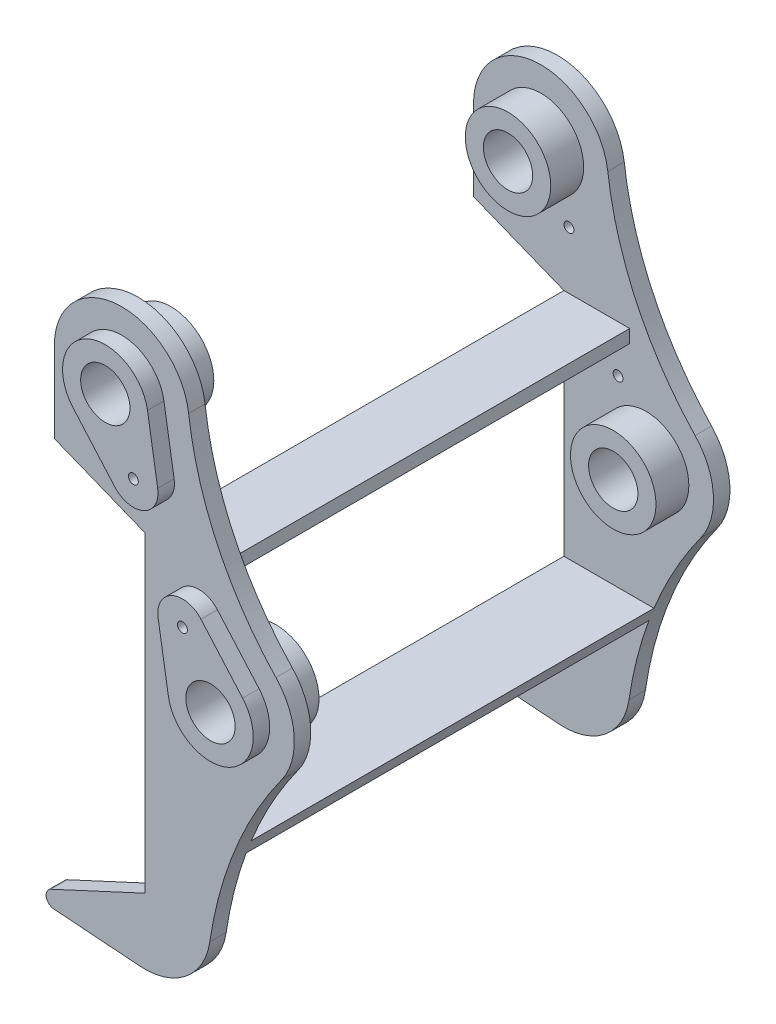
ISO-10303-21;
HEADER;
FILE_DESCRIPTION(('STEP AP214'),'2;1');
FILE_NAME('part.step','',(''),(''),'','','');
FILE_SCHEMA(('AUTOMOTIVE_DESIGN { 1 0 10303 214 1 1 1 1 }'));
ENDSEC;
DATA;
#1=APPLICATION_CONTEXT('core data for automotive mechanical design processes');
#2=APPLICATION_PROTOCOL_DEFINITION('international standard','automotive_design',2000,#1);
#3=PRODUCT_CONTEXT('',#1,'mechanical');
#4=PRODUCT('Part','Part','',(#3));
#5=PRODUCT_RELATED_PRODUCT_CATEGORY('part','',(#4));
#6=PRODUCT_DEFINITION_FORMATION('','',#4);
#7=PRODUCT_DEFINITION_CONTEXT('part definition',#1,'design');
#8=PRODUCT_DEFINITION('design','',#6,#7);
#9=PRODUCT_DEFINITION_SHAPE('','',#8);
#10=(LENGTH_UNIT() NAMED_UNIT(*) SI_UNIT(.MILLI.,.METRE.));
#11=(NAMED_UNIT(*) PLANE_ANGLE_UNIT() SI_UNIT($,.RADIAN.));
#12=(NAMED_UNIT(*) SI_UNIT($,.STERADIAN.) SOLID_ANGLE_UNIT());
#13=UNCERTAINTY_MEASURE_WITH_UNIT(LENGTH_MEASURE(1.E-05),#10,'distance_accuracy_value','');
#14=(GEOMETRIC_REPRESENTATION_CONTEXT(3) GLOBAL_UNCERTAINTY_ASSIGNED_CONTEXT((#13)) GLOBAL_UNIT_ASSIGNED_CONTEXT((#10,
#11,#12)) REPRESENTATION_CONTEXT('',''));
#15=CARTESIAN_POINT('',(0.,0.,0.));
#16=DIRECTION('',(0.,0.,1.));
#17=DIRECTION('',(1.,0.,0.));
#18=AXIS2_PLACEMENT_3D('',#15,#16,#17);
#19=CARTESIAN_POINT('',(-41.,-292.,122.5));
#20=DIRECTION('',(0.,0.,1.));
#21=DIRECTION('',(1.,0.,0.));
#22=AXIS2_PLACEMENT_3D('',#19,#20,#21);
#23=PLANE('',#22);
#24=CARTESIAN_POINT('',(64.,-135.661343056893,122.5));
#25=DIRECTION('',(0.,0.,1.));
#26=DIRECTION('',(1.,0.,0.));
#27=AXIS2_PLACEMENT_3D('',#24,#25,#26);
#28=CIRCLE('',#27,26.);
#29=CARTESIAN_POINT('',(90.,-135.661343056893,122.5));
#30=VERTEX_POINT('',#29);
#31=EDGE_CURVE('E11',#30,#30,#28,.F.);
#32=ORIENTED_EDGE('',*,*,#31,.F.);
#33=EDGE_LOOP('',(#32));
#34=FACE_BOUND('',#33,.T.);
#35=CARTESIAN_POINT('',(0.,0.,122.5));
#36=DIRECTION('',(0.,0.,1.));
#37=DIRECTION('',(1.,0.,0.));
#38=AXIS2_PLACEMENT_3D('',#35,#36,#37);
#39=CIRCLE('',#38,26.);
#40=CARTESIAN_POINT('',(26.,0.,122.5));
#41=VERTEX_POINT('',#40);
#42=EDGE_CURVE('E48',#41,#41,#39,.F.);
#43=ORIENTED_EDGE('',*,*,#42,.F.);
#44=EDGE_LOOP('',(#43));
#45=FACE_BOUND('',#44,.T.);
#46=CARTESIAN_POINT('',(46.9333333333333,-99.4849849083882,122.5));
#47=DIRECTION('',(0.,0.,1.));
#48=DIRECTION('',(1.,0.,0.));
#49=AXIS2_PLACEMENT_3D('',#46,#47,#48);
#50=CIRCLE('',#49,3.);
#51=CARTESIAN_POINT('',(49.9333333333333,-99.4849849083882,122.5));
#52=VERTEX_POINT('',#51);
#53=EDGE_CURVE('E581',#52,#52,#50,.T.);
#54=ORIENTED_EDGE('',*,*,#53,.T.);
#55=EDGE_LOOP('',(#54));
#56=FACE_BOUND('',#55,.T.);
#57=CARTESIAN_POINT('',(17.0666666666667,-36.1763581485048,122.5));
#58=DIRECTION('',(0.,0.,1.));
#59=DIRECTION('',(1.,0.,0.));
#60=AXIS2_PLACEMENT_3D('',#57,#58,#59);
#61=CIRCLE('',#60,3.);
#62=CARTESIAN_POINT('',(20.0666666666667,-36.1763581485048,122.5));
#63=VERTEX_POINT('',#62);
#64=EDGE_CURVE('E575',#63,#63,#61,.T.);
#65=ORIENTED_EDGE('',*,*,#64,.T.);
#66=EDGE_LOOP('',(#65));
#67=FACE_BOUND('',#66,.T.);
#68=DIRECTION('',(0.,1.,0.));
#69=VECTOR('',#68,1.);
#70=CARTESIAN_POINT('',(54.0000000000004,-292.,122.5));
#71=LINE('',#70,#69);
#72=CARTESIAN_POINT('',(54.,-79.,122.5));
#73=VERTEX_POINT('',#72);
#74=CARTESIAN_POINT('',(54.,-71.,122.5));
#75=VERTEX_POINT('',#74);
#76=EDGE_CURVE('E339',#73,#75,#71,.T.);
#77=ORIENTED_EDGE('',*,*,#76,.T.);
#78=DIRECTION('',(-1.,0.,0.));
#79=VECTOR('',#78,1.);
#80=CARTESIAN_POINT('',(-41.,-71.,122.5));
#81=LINE('',#80,#79);
#82=CARTESIAN_POINT('',(14.,-71.,122.5));
#83=VERTEX_POINT('',#82);
#84=EDGE_CURVE('E354',#75,#83,#81,.T.);
#85=ORIENTED_EDGE('',*,*,#84,.T.);
#86=DIRECTION('',(0.928476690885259,-0.371390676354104,0.));
#87=VECTOR('',#86,1.);
#88=CARTESIAN_POINT('',(-41.,-49.,122.5));
#89=LINE('',#88,#87);
#90=CARTESIAN_POINT('',(-41.,-49.,122.5));
#91=VERTEX_POINT('',#90);
#92=EDGE_CURVE('E676',#91,#83,#89,.T.);
#93=ORIENTED_EDGE('',*,*,#92,.F.);
#94=DIRECTION('',(0.,-1.,0.));
#95=VECTOR('',#94,1.);
#96=CARTESIAN_POINT('',(-41.,0.,122.5));
#97=LINE('',#96,#95);
#98=CARTESIAN_POINT('',(-41.,0.,122.5));
#99=VERTEX_POINT('',#98);
#100=EDGE_CURVE('E674',#99,#91,#97,.T.);
#101=ORIENTED_EDGE('',*,*,#100,.F.);
#102=CARTESIAN_POINT('',(0.,0.,122.5));
#103=DIRECTION('',(0.,0.,1.));
#104=DIRECTION('',(1.,0.,0.));
#105=AXIS2_PLACEMENT_3D('',#102,#103,#104);
#106=CIRCLE('',#105,41.);
#107=CARTESIAN_POINT('',(40.6834440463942,5.08501529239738,122.5));
#108=VERTEX_POINT('',#107);
#109=EDGE_CURVE('E672',#108,#99,#106,.T.);
#110=ORIENTED_EDGE('',*,*,#109,.F.);
#111=CARTESIAN_POINT('',(239.139268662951,29.8899679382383,122.5));
#112=DIRECTION('',(0.,0.,-1.));
#113=DIRECTION('',(1.,0.,0.));
#114=AXIS2_PLACEMENT_3D('',#111,#112,#113);
#115=CIRCLE('',#114,200.);
#116=CARTESIAN_POINT('',(93.7954772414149,-107.497012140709,122.5));
#117=VERTEX_POINT('',#116);
#118=EDGE_CURVE('E670',#117,#108,#115,.T.);
#119=ORIENTED_EDGE('',*,*,#118,.F.);
#120=CARTESIAN_POINT('',(64.,-135.661343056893,122.5));
#121=DIRECTION('',(0.,0.,1.));
#122=DIRECTION('',(1.,0.,0.));
#123=AXIS2_PLACEMENT_3D('',#120,#121,#122);
#124=CIRCLE('',#123,41.);
#125=CARTESIAN_POINT('',(97.1998207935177,-159.719021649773,122.5));
#126=VERTEX_POINT('',#125);
#127=EDGE_CURVE('E668',#126,#117,#124,.T.);
#128=ORIENTED_EDGE('',*,*,#127,.F.);
#129=CARTESIAN_POINT('',(293.969490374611,-302.304775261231,122.5));
#130=DIRECTION('',(0.,0.,-1.));
#131=DIRECTION('',(1.,0.,0.));
#132=AXIS2_PLACEMENT_3D('',#129,#130,#131);
#133=CIRCLE('',#132,243.);
#134=CARTESIAN_POINT('',(68.7752675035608,-211.,122.5));
#135=VERTEX_POINT('',#134);
#136=EDGE_CURVE('E664',#135,#126,#133,.T.);
#137=ORIENTED_EDGE('',*,*,#136,.F.);
#138=DIRECTION('',(-1.,0.,0.));
#139=VECTOR('',#138,1.);
#140=CARTESIAN_POINT('',(-41.,-211.,122.5));
#141=LINE('',#140,#139);
#142=CARTESIAN_POINT('',(14.,-211.,122.5));
#143=VERTEX_POINT('',#142);
#144=EDGE_CURVE('E569',#135,#143,#141,.T.);
#145=ORIENTED_EDGE('',*,*,#144,.T.);
#146=DIRECTION('',(0.,-1.,0.));
#147=VECTOR('',#146,1.);
#148=CARTESIAN_POINT('',(14.,-71.,122.5));
#149=LINE('',#148,#147);
#150=CARTESIAN_POINT('',(14.,-79.,122.5));
#151=VERTEX_POINT('',#150);
#152=EDGE_CURVE('E680',#151,#143,#149,.T.);
#153=ORIENTED_EDGE('',*,*,#152,.F.);
#154=DIRECTION('',(1.,0.,0.));
#155=VECTOR('',#154,1.);
#156=CARTESIAN_POINT('',(-41.,-79.,122.5));
#157=LINE('',#156,#155);
#158=EDGE_CURVE('E347',#151,#73,#157,.T.);
#159=ORIENTED_EDGE('',*,*,#158,.T.);
#160=EDGE_LOOP('',(#77,#85,#93,#101,#110,#119,#128,#137,#145,#153,#159));
#161=FACE_BOUND('',#160,.T.);
#162=ADVANCED_FACE('F39',(#34,#45,#56,#67,#161),#23,.F.);
#163=CARTESIAN_POINT('',(14.,-219.,122.5));
#164=VERTEX_POINT('',#163);
#165=CARTESIAN_POINT('',(14.,-261.,122.5));
#166=VERTEX_POINT('',#165);
#167=EDGE_CURVE('E679',#164,#166,#149,.T.);
#168=ORIENTED_EDGE('',*,*,#167,.F.);
#169=DIRECTION('',(1.,0.,0.));
#170=VECTOR('',#169,1.);
#171=CARTESIAN_POINT('',(-41.,-219.,122.5));
#172=LINE('',#171,#170);
#173=CARTESIAN_POINT('',(65.6948434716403,-219.,122.5));
#174=VERTEX_POINT('',#173);
#175=EDGE_CURVE('E566',#164,#174,#172,.T.);
#176=ORIENTED_EDGE('',*,*,#175,.T.);
#177=CARTESIAN_POINT('',(53.5716594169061,-266.838130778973,122.5));
#178=VERTEX_POINT('',#177);
#179=EDGE_CURVE('E665',#178,#174,#133,.T.);
#180=ORIENTED_EDGE('',*,*,#179,.F.);
#181=CARTESIAN_POINT('',(14.,-261.,122.5));
#182=DIRECTION('',(0.,0.,1.));
#183=DIRECTION('',(1.,0.,0.));
#184=AXIS2_PLACEMENT_3D('',#181,#182,#183);
#185=CIRCLE('',#184,39.9999999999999);
#186=CARTESIAN_POINT('',(11.0286179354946,-300.889483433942,122.5));
#187=VERTEX_POINT('',#186);
#188=EDGE_CURVE('E662',#187,#178,#185,.T.);
#189=ORIENTED_EDGE('',*,*,#188,.F.);
#190=DIRECTION('',(0.997237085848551,-0.0742845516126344,0.));
#191=VECTOR('',#190,1.);
#192=CARTESIAN_POINT('',(11.0286179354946,-300.889483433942,122.5));
#193=LINE('',#192,#191);
#194=CARTESIAN_POINT('',(-41.3714227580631,-296.986185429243,122.5));
#195=VERTEX_POINT('',#194);
#196=EDGE_CURVE('E660',#195,#187,#193,.T.);
#197=ORIENTED_EDGE('',*,*,#196,.F.);
#198=CARTESIAN_POINT('',(-41.,-292.,122.5));
#199=DIRECTION('',(0.,0.,1.));
#200=DIRECTION('',(1.,0.,0.));
#201=AXIS2_PLACEMENT_3D('',#198,#199,#200);
#202=CIRCLE('',#201,5.00000000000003);
#203=CARTESIAN_POINT('',(-43.1023968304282,-287.463489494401,122.5));
#204=VERTEX_POINT('',#203);
#205=EDGE_CURVE('E658',#204,#195,#202,.T.);
#206=ORIENTED_EDGE('',*,*,#205,.F.);
#207=DIRECTION('',(-0.907302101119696,-0.420479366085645,0.));
#208=VECTOR('',#207,1.);
#209=CARTESIAN_POINT('',(14.,-261.,122.5));
#210=LINE('',#209,#208);
#211=EDGE_CURVE('E655',#166,#204,#210,.T.);
#212=ORIENTED_EDGE('',*,*,#211,.F.);
#213=EDGE_LOOP('',(#168,#176,#180,#189,#197,#206,#212));
#214=FACE_BOUND('',#213,.T.);
#215=ADVANCED_FACE('F761',(#214),#23,.F.);
#216=CARTESIAN_POINT('',(-41.,-292.,132.5));
#217=DIRECTION('',(0.,0.,1.));
#218=DIRECTION('',(1.,0.,0.));
#219=AXIS2_PLACEMENT_3D('',#216,#217,#218);
#220=PLANE('',#219);
#221=DIRECTION('',(0.928476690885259,-0.371390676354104,0.));
#222=VECTOR('',#221,1.);
#223=CARTESIAN_POINT('',(-41.,-49.,132.5));
#224=LINE('',#223,#222);
#225=CARTESIAN_POINT('',(-41.,-49.,132.5));
#226=VERTEX_POINT('',#225);
#227=CARTESIAN_POINT('',(14.,-71.,132.5));
#228=VERTEX_POINT('',#227);
#229=EDGE_CURVE('E701',#226,#228,#224,.T.);
#230=ORIENTED_EDGE('',*,*,#229,.T.);
#231=DIRECTION('',(0.,-1.,0.));
#232=VECTOR('',#231,1.);
#233=CARTESIAN_POINT('',(14.,-71.,132.5));
#234=LINE('',#233,#232);
#235=CARTESIAN_POINT('',(14.,-261.,132.5));
#236=VERTEX_POINT('',#235);
#237=EDGE_CURVE('E703',#228,#236,#234,.T.);
#238=ORIENTED_EDGE('',*,*,#237,.T.);
#239=DIRECTION('',(-0.907302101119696,-0.420479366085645,0.));
#240=VECTOR('',#239,1.);
#241=CARTESIAN_POINT('',(14.,-261.,132.5));
#242=LINE('',#241,#240);
#243=CARTESIAN_POINT('',(-43.1023968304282,-287.463489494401,132.5));
#244=VERTEX_POINT('',#243);
#245=EDGE_CURVE('E682',#236,#244,#242,.T.);
#246=ORIENTED_EDGE('',*,*,#245,.T.);
#247=CARTESIAN_POINT('',(-41.,-292.,132.5));
#248=DIRECTION('',(0.,0.,1.));
#249=DIRECTION('',(1.,0.,0.));
#250=AXIS2_PLACEMENT_3D('',#247,#248,#249);
#251=CIRCLE('',#250,5.00000000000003);
#252=CARTESIAN_POINT('',(-41.3714227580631,-296.986185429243,132.5));
#253=VERTEX_POINT('',#252);
#254=EDGE_CURVE('E685',#244,#253,#251,.T.);
#255=ORIENTED_EDGE('',*,*,#254,.T.);
#256=DIRECTION('',(0.997237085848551,-0.0742845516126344,0.));
#257=VECTOR('',#256,1.);
#258=CARTESIAN_POINT('',(11.0286179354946,-300.889483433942,132.5));
#259=LINE('',#258,#257);
#260=CARTESIAN_POINT('',(11.0286179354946,-300.889483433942,132.5));
#261=VERTEX_POINT('',#260);
#262=EDGE_CURVE('E687',#253,#261,#259,.T.);
#263=ORIENTED_EDGE('',*,*,#262,.T.);
#264=CARTESIAN_POINT('',(14.,-261.,132.5));
#265=DIRECTION('',(0.,0.,1.));
#266=DIRECTION('',(1.,0.,0.));
#267=AXIS2_PLACEMENT_3D('',#264,#265,#266);
#268=CIRCLE('',#267,39.9999999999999);
#269=CARTESIAN_POINT('',(53.5716594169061,-266.838130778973,132.5));
#270=VERTEX_POINT('',#269);
#271=EDGE_CURVE('E689',#261,#270,#268,.T.);
#272=ORIENTED_EDGE('',*,*,#271,.T.);
#273=CARTESIAN_POINT('',(293.969490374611,-302.304775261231,132.5));
#274=DIRECTION('',(0.,0.,-1.));
#275=DIRECTION('',(1.,0.,0.));
#276=AXIS2_PLACEMENT_3D('',#273,#274,#275);
#277=CIRCLE('',#276,243.);
#278=CARTESIAN_POINT('',(97.1998207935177,-159.719021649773,132.5));
#279=VERTEX_POINT('',#278);
#280=EDGE_CURVE('E691',#270,#279,#277,.T.);
#281=ORIENTED_EDGE('',*,*,#280,.T.);
#282=CARTESIAN_POINT('',(64.,-135.661343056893,132.5));
#283=DIRECTION('',(0.,0.,1.));
#284=DIRECTION('',(1.,0.,0.));
#285=AXIS2_PLACEMENT_3D('',#282,#283,#284);
#286=CIRCLE('',#285,41.);
#287=CARTESIAN_POINT('',(93.7954772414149,-107.497012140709,132.5));
#288=VERTEX_POINT('',#287);
#289=EDGE_CURVE('E693',#279,#288,#286,.T.);
#290=ORIENTED_EDGE('',*,*,#289,.T.);
#291=CARTESIAN_POINT('',(239.139268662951,29.8899679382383,132.5));
#292=DIRECTION('',(0.,0.,-1.));
#293=DIRECTION('',(1.,0.,0.));
#294=AXIS2_PLACEMENT_3D('',#291,#292,#293);
#295=CIRCLE('',#294,200.);
#296=CARTESIAN_POINT('',(40.6834440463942,5.08501529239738,132.5));
#297=VERTEX_POINT('',#296);
#298=EDGE_CURVE('E695',#288,#297,#295,.T.);
#299=ORIENTED_EDGE('',*,*,#298,.T.);
#300=CARTESIAN_POINT('',(0.,0.,132.5));
#301=DIRECTION('',(0.,0.,1.));
#302=DIRECTION('',(1.,0.,0.));
#303=AXIS2_PLACEMENT_3D('',#300,#301,#302);
#304=CIRCLE('',#303,41.);
#305=CARTESIAN_POINT('',(-41.,0.,132.5));
#306=VERTEX_POINT('',#305);
#307=EDGE_CURVE('E697',#297,#306,#304,.T.);
#308=ORIENTED_EDGE('',*,*,#307,.T.);
#309=DIRECTION('',(0.,-1.,0.));
#310=VECTOR('',#309,1.);
#311=CARTESIAN_POINT('',(-41.,0.,132.5));
#312=LINE('',#311,#310);
#313=EDGE_CURVE('E699',#306,#226,#312,.T.);
#314=ORIENTED_EDGE('',*,*,#313,.T.);
#315=EDGE_LOOP('',(#230,#238,#246,#255,#263,#272,#281,#290,#299,#308,#314));
#316=FACE_BOUND('',#315,.T.);
#317=DIRECTION('',(0.16150374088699,-0.986872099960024,0.));
#318=VECTOR('',#317,1.);
#319=CARTESIAN_POINT('',(32.130251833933,-101.907541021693,132.5));
#320=LINE('',#319,#318);
#321=CARTESIAN_POINT('',(32.130251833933,-101.907541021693,132.5));
#322=VERTEX_POINT('',#321);
#323=CARTESIAN_POINT('',(38.3413254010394,-139.860440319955,132.5));
#324=VERTEX_POINT('',#323);
#325=EDGE_CURVE('E600',#322,#324,#320,.T.);
#326=ORIENTED_EDGE('',*,*,#325,.F.);
#327=CARTESIAN_POINT('',(46.9333333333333,-99.4849849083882,132.5));
#328=DIRECTION('',(0.,0.,1.));
#329=DIRECTION('',(1.,0.,0.));
#330=AXIS2_PLACEMENT_3D('',#327,#328,#329);
#331=CIRCLE('',#330,15.);
#332=CARTESIAN_POINT('',(58.2164148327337,-89.6010549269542,132.5));
#333=VERTEX_POINT('',#332);
#334=EDGE_CURVE('E597',#333,#322,#331,.T.);
#335=ORIENTED_EDGE('',*,*,#334,.F.);
#336=DIRECTION('',(-0.658928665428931,0.752205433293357,0.));
#337=VECTOR('',#336,1.);
#338=CARTESIAN_POINT('',(58.2164148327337,-89.6010549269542,132.5));
#339=LINE('',#338,#337);
#340=CARTESIAN_POINT('',(83.5573412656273,-118.529197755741,132.5));
#341=VERTEX_POINT('',#340);
#342=EDGE_CURVE('E605',#341,#333,#339,.T.);
#343=ORIENTED_EDGE('',*,*,#342,.F.);
#344=CARTESIAN_POINT('',(64.,-135.661343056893,132.5));
#345=DIRECTION('',(0.,0.,1.));
#346=DIRECTION('',(1.,0.,0.));
#347=AXIS2_PLACEMENT_3D('',#344,#345,#346);
#348=CIRCLE('',#347,26.);
#349=EDGE_CURVE('E602',#324,#341,#348,.T.);
#350=ORIENTED_EDGE('',*,*,#349,.F.);
#351=EDGE_LOOP('',(#326,#335,#343,#350));
#352=FACE_BOUND('',#351,.T.);
#353=DIRECTION('',(0.658928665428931,-0.752205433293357,0.));
#354=VECTOR('',#353,1.);
#355=CARTESIAN_POINT('',(-19.5573412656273,-17.1321453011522,132.5));
#356=LINE('',#355,#354);
#357=CARTESIAN_POINT('',(-19.5573412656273,-17.1321453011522,132.5));
#358=VERTEX_POINT('',#357);
#359=CARTESIAN_POINT('',(5.7835851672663,-46.0602881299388,132.5));
#360=VERTEX_POINT('',#359);
#361=EDGE_CURVE('E629',#358,#360,#356,.T.);
#362=ORIENTED_EDGE('',*,*,#361,.F.);
#363=CARTESIAN_POINT('',(0.,0.,132.5));
#364=DIRECTION('',(0.,0.,1.));
#365=DIRECTION('',(1.,0.,0.));
#366=AXIS2_PLACEMENT_3D('',#363,#364,#365);
#367=CIRCLE('',#366,26.);
#368=CARTESIAN_POINT('',(25.6586745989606,4.19909726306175,132.5));
#369=VERTEX_POINT('',#368);
#370=EDGE_CURVE('E626',#369,#358,#367,.T.);
#371=ORIENTED_EDGE('',*,*,#370,.F.);
#372=DIRECTION('',(-0.16150374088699,0.986872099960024,0.));
#373=VECTOR('',#372,1.);
#374=CARTESIAN_POINT('',(25.6586745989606,4.19909726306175,132.5));
#375=LINE('',#374,#373);
#376=CARTESIAN_POINT('',(31.869748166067,-33.7538020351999,132.5));
#377=VERTEX_POINT('',#376);
#378=EDGE_CURVE('E634',#377,#369,#375,.T.);
#379=ORIENTED_EDGE('',*,*,#378,.F.);
#380=CARTESIAN_POINT('',(17.0666666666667,-36.1763581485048,132.5));
#381=DIRECTION('',(0.,0.,1.));
#382=DIRECTION('',(1.,0.,0.));
#383=AXIS2_PLACEMENT_3D('',#380,#381,#382);
#384=CIRCLE('',#383,15.);
#385=EDGE_CURVE('E631',#360,#377,#384,.T.);
#386=ORIENTED_EDGE('',*,*,#385,.F.);
#387=EDGE_LOOP('',(#362,#371,#379,#386));
#388=FACE_BOUND('',#387,.T.);
#389=ADVANCED_FACE('F795',(#316,#352,#388),#220,.T.);
#390=CARTESIAN_POINT('',(14.,-261.,132.5));
#391=DIRECTION('',(0.420479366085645,-0.907302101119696,0.));
#392=DIRECTION('',(0.907302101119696,0.420479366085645,0.));
#393=AXIS2_PLACEMENT_3D('',#390,#391,#392);
#394=PLANE('',#393);
#395=ORIENTED_EDGE('',*,*,#211,.T.);
#396=DIRECTION('',(0.,0.,-1.));
#397=VECTOR('',#396,1.);
#398=CARTESIAN_POINT('',(-43.1023968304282,-287.463489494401,132.5));
#399=LINE('',#398,#397);
#400=EDGE_CURVE('E735',#244,#204,#399,.T.);
#401=ORIENTED_EDGE('',*,*,#400,.F.);
#402=ORIENTED_EDGE('',*,*,#245,.F.);
#403=DIRECTION('',(0.,0.,-1.));
#404=VECTOR('',#403,1.);
#405=CARTESIAN_POINT('',(14.,-261.,132.5));
#406=LINE('',#405,#404);
#407=EDGE_CURVE('E705',#236,#166,#406,.T.);
#408=ORIENTED_EDGE('',*,*,#407,.T.);
#409=EDGE_LOOP('',(#395,#401,#402,#408));
#410=FACE_BOUND('',#409,.T.);
#411=ADVANCED_FACE('F41',(#410),#394,.F.);
#412=CARTESIAN_POINT('',(-41.,-292.,132.5));
#413=DIRECTION('',(0.,0.,-1.));
#414=DIRECTION('',(-1.,0.,0.));
#415=AXIS2_PLACEMENT_3D('',#412,#413,#414);
#416=CYLINDRICAL_SURFACE('',#415,5.00000000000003);
#417=ORIENTED_EDGE('',*,*,#205,.T.);
#418=DIRECTION('',(0.,0.,-1.));
#419=VECTOR('',#418,1.);
#420=CARTESIAN_POINT('',(-41.3714227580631,-296.986185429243,132.5));
#421=LINE('',#420,#419);
#422=EDGE_CURVE('E732',#253,#195,#421,.T.);
#423=ORIENTED_EDGE('',*,*,#422,.F.);
#424=ORIENTED_EDGE('',*,*,#254,.F.);
#425=ORIENTED_EDGE('',*,*,#400,.T.);
#426=EDGE_LOOP('',(#417,#423,#424,#425));
#427=FACE_BOUND('',#426,.T.);
#428=ADVANCED_FACE('F893',(#427),#416,.T.);
#429=CARTESIAN_POINT('',(11.0286179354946,-300.889483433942,132.5));
#430=DIRECTION('',(0.0742845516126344,0.997237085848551,0.));
#431=DIRECTION('',(-0.997237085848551,0.0742845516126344,0.));
#432=AXIS2_PLACEMENT_3D('',#429,#430,#431);
#433=PLANE('',#432);
#434=ORIENTED_EDGE('',*,*,#196,.T.);
#435=DIRECTION('',(0.,0.,-1.));
#436=VECTOR('',#435,1.);
#437=CARTESIAN_POINT('',(11.0286179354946,-300.889483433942,132.5));
#438=LINE('',#437,#436);
#439=EDGE_CURVE('E729',#261,#187,#438,.T.);
#440=ORIENTED_EDGE('',*,*,#439,.F.);
#441=ORIENTED_EDGE('',*,*,#262,.F.);
#442=ORIENTED_EDGE('',*,*,#422,.T.);
#443=EDGE_LOOP('',(#434,#440,#441,#442));
#444=FACE_BOUND('',#443,.T.);
#445=ADVANCED_FACE('F891',(#444),#433,.F.);
#446=CARTESIAN_POINT('',(14.,-261.,132.5));
#447=DIRECTION('',(0.,0.,-1.));
#448=DIRECTION('',(-1.,0.,0.));
#449=AXIS2_PLACEMENT_3D('',#446,#447,#448);
#450=CYLINDRICAL_SURFACE('',#449,39.9999999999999);
#451=ORIENTED_EDGE('',*,*,#188,.T.);
#452=DIRECTION('',(0.,0.,-1.));
#453=VECTOR('',#452,1.);
#454=CARTESIAN_POINT('',(53.5716594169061,-266.838130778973,132.5));
#455=LINE('',#454,#453);
#456=EDGE_CURVE('E726',#270,#178,#455,.T.);
#457=ORIENTED_EDGE('',*,*,#456,.F.);
#458=ORIENTED_EDGE('',*,*,#271,.F.);
#459=ORIENTED_EDGE('',*,*,#439,.T.);
#460=EDGE_LOOP('',(#451,#457,#458,#459));
#461=FACE_BOUND('',#460,.T.);
#462=ADVANCED_FACE('F888',(#461),#450,.T.);
#463=CARTESIAN_POINT('',(293.969490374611,-302.304775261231,132.5));
#464=DIRECTION('',(0.,0.,-1.));
#465=DIRECTION('',(-1.,0.,0.));
#466=AXIS2_PLACEMENT_3D('',#463,#464,#465);
#467=CYLINDRICAL_SURFACE('',#466,243.);
#468=ORIENTED_EDGE('',*,*,#179,.T.);
#469=DIRECTION('',(0.,0.,1.));
#470=VECTOR('',#469,1.);
#471=CARTESIAN_POINT('',(65.6948434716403,-219.,-177.856390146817));
#472=LINE('',#471,#470);
#473=CARTESIAN_POINT('',(65.6948434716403,-219.,-122.5));
#474=VERTEX_POINT('',#473);
#475=EDGE_CURVE('E560',#474,#174,#472,.T.);
#476=ORIENTED_EDGE('',*,*,#475,.F.);
#477=CARTESIAN_POINT('',(293.969490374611,-302.304775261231,-122.5));
#478=DIRECTION('',(0.,0.,-1.));
#479=DIRECTION('',(1.,0.,0.));
#480=AXIS2_PLACEMENT_3D('',#477,#478,#479);
#481=CIRCLE('',#480,243.);
#482=CARTESIAN_POINT('',(53.5716594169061,-266.838130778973,-122.5));
#483=VERTEX_POINT('',#482);
#484=EDGE_CURVE('E469',#483,#474,#481,.T.);
#485=ORIENTED_EDGE('',*,*,#484,.F.);
#486=DIRECTION('',(0.,0.,1.));
#487=VECTOR('',#486,1.);
#488=CARTESIAN_POINT('',(53.5716594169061,-266.838130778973,-132.5));
#489=LINE('',#488,#487);
#490=CARTESIAN_POINT('',(53.5716594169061,-266.838130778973,-132.5));
#491=VERTEX_POINT('',#490);
#492=EDGE_CURVE('E545',#491,#483,#489,.T.);
#493=ORIENTED_EDGE('',*,*,#492,.F.);
#494=CARTESIAN_POINT('',(293.969490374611,-302.304775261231,-132.5));
#495=DIRECTION('',(0.,0.,-1.));
#496=DIRECTION('',(1.,0.,0.));
#497=AXIS2_PLACEMENT_3D('',#494,#495,#496);
#498=CIRCLE('',#497,243.);
#499=CARTESIAN_POINT('',(97.1998207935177,-159.719021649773,-132.5));
#500=VERTEX_POINT('',#499);
#501=EDGE_CURVE('E501',#491,#500,#498,.T.);
#502=ORIENTED_EDGE('',*,*,#501,.T.);
#503=DIRECTION('',(0.,0.,1.));
#504=VECTOR('',#503,1.);
#505=CARTESIAN_POINT('',(97.1998207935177,-159.719021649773,-132.5));
#506=LINE('',#505,#504);
#507=CARTESIAN_POINT('',(97.1998207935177,-159.719021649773,-122.5));
#508=VERTEX_POINT('',#507);
#509=EDGE_CURVE('E542',#500,#508,#506,.T.);
#510=ORIENTED_EDGE('',*,*,#509,.T.);
#511=CARTESIAN_POINT('',(68.7752675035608,-211.,-122.5));
#512=VERTEX_POINT('',#511);
#513=EDGE_CURVE('E468',#512,#508,#481,.T.);
#514=ORIENTED_EDGE('',*,*,#513,.F.);
#515=DIRECTION('',(0.,0.,1.));
#516=VECTOR('',#515,1.);
#517=CARTESIAN_POINT('',(68.7752675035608,-211.,-177.856390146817));
#518=LINE('',#517,#516);
#519=EDGE_CURVE('E557',#512,#135,#518,.T.);
#520=ORIENTED_EDGE('',*,*,#519,.T.);
#521=ORIENTED_EDGE('',*,*,#136,.T.);
#522=DIRECTION('',(0.,0.,-1.));
#523=VECTOR('',#522,1.);
#524=CARTESIAN_POINT('',(97.1998207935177,-159.719021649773,132.5));
#525=LINE('',#524,#523);
#526=EDGE_CURVE('E723',#279,#126,#525,.T.);
#527=ORIENTED_EDGE('',*,*,#526,.F.);
#528=ORIENTED_EDGE('',*,*,#280,.F.);
#529=ORIENTED_EDGE('',*,*,#456,.T.);
#530=EDGE_LOOP('',(#468,#476,#485,#493,#502,#510,#514,#520,#521,#527,#528,#529));
#531=FACE_BOUND('',#530,.T.);
#532=ADVANCED_FACE('F780',(#531),#467,.F.);
#533=CARTESIAN_POINT('',(64.,-135.661343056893,132.5));
#534=DIRECTION('',(0.,0.,-1.));
#535=DIRECTION('',(-1.,0.,0.));
#536=AXIS2_PLACEMENT_3D('',#533,#534,#535);
#537=CYLINDRICAL_SURFACE('',#536,41.);
#538=ORIENTED_EDGE('',*,*,#127,.T.);
#539=DIRECTION('',(0.,0.,-1.));
#540=VECTOR('',#539,1.);
#541=CARTESIAN_POINT('',(93.7954772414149,-107.497012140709,132.5));
#542=LINE('',#541,#540);
#543=EDGE_CURVE('E720',#288,#117,#542,.T.);
#544=ORIENTED_EDGE('',*,*,#543,.F.);
#545=ORIENTED_EDGE('',*,*,#289,.F.);
#546=ORIENTED_EDGE('',*,*,#526,.T.);
#547=EDGE_LOOP('',(#538,#544,#545,#546));
#548=FACE_BOUND('',#547,.T.);
#549=ADVANCED_FACE('F787',(#548),#537,.T.);
#550=CARTESIAN_POINT('',(239.139268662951,29.8899679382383,132.5));
#551=DIRECTION('',(0.,0.,-1.));
#552=DIRECTION('',(-1.,0.,0.));
#553=AXIS2_PLACEMENT_3D('',#550,#551,#552);
#554=CYLINDRICAL_SURFACE('',#553,200.);
#555=ORIENTED_EDGE('',*,*,#118,.T.);
#556=DIRECTION('',(0.,0.,-1.));
#557=VECTOR('',#556,1.);
#558=CARTESIAN_POINT('',(40.6834440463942,5.08501529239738,132.5));
#559=LINE('',#558,#557);
#560=EDGE_CURVE('E717',#297,#108,#559,.T.);
#561=ORIENTED_EDGE('',*,*,#560,.F.);
#562=ORIENTED_EDGE('',*,*,#298,.F.);
#563=ORIENTED_EDGE('',*,*,#543,.T.);
#564=EDGE_LOOP('',(#555,#561,#562,#563));
#565=FACE_BOUND('',#564,.T.);
#566=ADVANCED_FACE('F791',(#565),#554,.F.);
#567=CARTESIAN_POINT('',(0.,0.,132.5));
#568=DIRECTION('',(0.,0.,-1.));
#569=DIRECTION('',(-1.,0.,0.));
#570=AXIS2_PLACEMENT_3D('',#567,#568,#569);
#571=CYLINDRICAL_SURFACE('',#570,41.);
#572=ORIENTED_EDGE('',*,*,#109,.T.);
#573=DIRECTION('',(0.,0.,-1.));
#574=VECTOR('',#573,1.);
#575=CARTESIAN_POINT('',(-41.,0.,132.5));
#576=LINE('',#575,#574);
#577=EDGE_CURVE('E714',#306,#99,#576,.T.);
#578=ORIENTED_EDGE('',*,*,#577,.F.);
#579=ORIENTED_EDGE('',*,*,#307,.F.);
#580=ORIENTED_EDGE('',*,*,#560,.T.);
#581=EDGE_LOOP('',(#572,#578,#579,#580));
#582=FACE_BOUND('',#581,.T.);
#583=ADVANCED_FACE('F873',(#582),#571,.T.);
#584=CARTESIAN_POINT('',(-41.,0.,132.5));
#585=DIRECTION('',(1.,0.,0.));
#586=DIRECTION('',(0.,1.,0.));
#587=AXIS2_PLACEMENT_3D('',#584,#585,#586);
#588=PLANE('',#587);
#589=ORIENTED_EDGE('',*,*,#100,.T.);
#590=DIRECTION('',(0.,0.,-1.));
#591=VECTOR('',#590,1.);
#592=CARTESIAN_POINT('',(-41.,-49.,132.5));
#593=LINE('',#592,#591);
#594=EDGE_CURVE('E711',#226,#91,#593,.T.);
#595=ORIENTED_EDGE('',*,*,#594,.F.);
#596=ORIENTED_EDGE('',*,*,#313,.F.);
#597=ORIENTED_EDGE('',*,*,#577,.T.);
#598=EDGE_LOOP('',(#589,#595,#596,#597));
#599=FACE_BOUND('',#598,.T.);
#600=ADVANCED_FACE('F870',(#599),#588,.F.);
#601=CARTESIAN_POINT('',(-41.,-49.,132.5));
#602=DIRECTION('',(0.371390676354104,0.928476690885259,0.));
#603=DIRECTION('',(-0.928476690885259,0.371390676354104,0.));
#604=AXIS2_PLACEMENT_3D('',#601,#602,#603);
#605=PLANE('',#604);
#606=ORIENTED_EDGE('',*,*,#92,.T.);
#607=DIRECTION('',(0.,0.,-1.));
#608=VECTOR('',#607,1.);
#609=CARTESIAN_POINT('',(14.,-71.,132.5));
#610=LINE('',#609,#608);
#611=EDGE_CURVE('E708',#228,#83,#610,.T.);
#612=ORIENTED_EDGE('',*,*,#611,.F.);
#613=ORIENTED_EDGE('',*,*,#229,.F.);
#614=ORIENTED_EDGE('',*,*,#594,.T.);
#615=EDGE_LOOP('',(#606,#612,#613,#614));
#616=FACE_BOUND('',#615,.T.);
#617=ADVANCED_FACE('F866',(#616),#605,.F.);
#618=CARTESIAN_POINT('',(14.,-71.,132.5));
#619=DIRECTION('',(1.,0.,0.));
#620=DIRECTION('',(0.,1.,0.));
#621=AXIS2_PLACEMENT_3D('',#618,#619,#620);
#622=PLANE('',#621);
#623=DIRECTION('',(0.,0.,1.));
#624=VECTOR('',#623,1.);
#625=CARTESIAN_POINT('',(14.,-79.,-177.856390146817));
#626=LINE('',#625,#624);
#627=CARTESIAN_POINT('',(14.,-79.,-122.5));
#628=VERTEX_POINT('',#627);
#629=EDGE_CURVE('E342',#628,#151,#626,.T.);
#630=ORIENTED_EDGE('',*,*,#629,.T.);
#631=ORIENTED_EDGE('',*,*,#152,.T.);
#632=DIRECTION('',(0.,0.,1.));
#633=VECTOR('',#632,1.);
#634=CARTESIAN_POINT('',(14.,-211.,-177.856390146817));
#635=LINE('',#634,#633);
#636=CARTESIAN_POINT('',(14.,-211.,-122.5));
#637=VERTEX_POINT('',#636);
#638=EDGE_CURVE('E554',#637,#143,#635,.T.);
#639=ORIENTED_EDGE('',*,*,#638,.F.);
#640=DIRECTION('',(0.,-1.,0.));
#641=VECTOR('',#640,1.);
#642=CARTESIAN_POINT('',(14.,-71.,-122.5));
#643=LINE('',#642,#641);
#644=EDGE_CURVE('E487',#628,#637,#643,.T.);
#645=ORIENTED_EDGE('',*,*,#644,.F.);
#646=EDGE_LOOP('',(#630,#631,#639,#645));
#647=FACE_BOUND('',#646,.T.);
#648=ORIENTED_EDGE('',*,*,#407,.F.);
#649=ORIENTED_EDGE('',*,*,#237,.F.);
#650=ORIENTED_EDGE('',*,*,#611,.T.);
#651=DIRECTION('',(0.,0.,1.));
#652=VECTOR('',#651,1.);
#653=CARTESIAN_POINT('',(14.,-71.,-177.856390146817));
#654=LINE('',#653,#652);
#655=CARTESIAN_POINT('',(14.,-71.,-122.5));
#656=VERTEX_POINT('',#655);
#657=EDGE_CURVE('E335',#656,#83,#654,.T.);
#658=ORIENTED_EDGE('',*,*,#657,.F.);
#659=DIRECTION('',(0.,0.,1.));
#660=VECTOR('',#659,1.);
#661=CARTESIAN_POINT('',(14.,-71.,-132.5));
#662=LINE('',#661,#660);
#663=CARTESIAN_POINT('',(14.,-71.,-132.5));
#664=VERTEX_POINT('',#663);
#665=EDGE_CURVE('E532',#664,#656,#662,.T.);
#666=ORIENTED_EDGE('',*,*,#665,.F.);
#667=DIRECTION('',(0.,-1.,0.));
#668=VECTOR('',#667,1.);
#669=CARTESIAN_POINT('',(14.,-71.,-132.5));
#670=LINE('',#669,#668);
#671=CARTESIAN_POINT('',(14.,-261.,-132.5));
#672=VERTEX_POINT('',#671);
#673=EDGE_CURVE('E519',#664,#672,#670,.T.);
#674=ORIENTED_EDGE('',*,*,#673,.T.);
#675=DIRECTION('',(0.,0.,1.));
#676=VECTOR('',#675,1.);
#677=CARTESIAN_POINT('',(14.,-261.,-132.5));
#678=LINE('',#677,#676);
#679=CARTESIAN_POINT('',(14.,-261.,-122.5));
#680=VERTEX_POINT('',#679);
#681=EDGE_CURVE('E529',#672,#680,#678,.T.);
#682=ORIENTED_EDGE('',*,*,#681,.T.);
#683=CARTESIAN_POINT('',(14.,-219.,-122.5));
#684=VERTEX_POINT('',#683);
#685=EDGE_CURVE('E486',#684,#680,#643,.T.);
#686=ORIENTED_EDGE('',*,*,#685,.F.);
#687=DIRECTION('',(0.,0.,1.));
#688=VECTOR('',#687,1.);
#689=CARTESIAN_POINT('',(14.,-219.,-177.856390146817));
#690=LINE('',#689,#688);
#691=EDGE_CURVE('E528',#684,#164,#690,.T.);
#692=ORIENTED_EDGE('',*,*,#691,.T.);
#693=ORIENTED_EDGE('',*,*,#167,.T.);
#694=EDGE_LOOP('',(#648,#649,#650,#658,#666,#674,#682,#686,#692,#693));
#695=FACE_BOUND('',#694,.T.);
#696=ADVANCED_FACE('F771',(#647,#695),#622,.F.);
#697=CARTESIAN_POINT('',(0.,0.,142.5));
#698=DIRECTION('',(0.,0.,-1.));
#699=DIRECTION('',(-1.,0.,0.));
#700=AXIS2_PLACEMENT_3D('',#697,#698,#699);
#701=CYLINDRICAL_SURFACE('',#700,26.);
#702=ORIENTED_EDGE('',*,*,#370,.T.);
#703=DIRECTION('',(0.,0.,-1.));
#704=VECTOR('',#703,1.);
#705=CARTESIAN_POINT('',(-19.5573412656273,-17.1321453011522,142.5));
#706=LINE('',#705,#704);
#707=CARTESIAN_POINT('',(-19.5573412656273,-17.1321453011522,142.5));
#708=VERTEX_POINT('',#707);
#709=EDGE_CURVE('E653',#708,#358,#706,.T.);
#710=ORIENTED_EDGE('',*,*,#709,.F.);
#711=CARTESIAN_POINT('',(0.,0.,142.5));
#712=DIRECTION('',(0.,0.,1.));
#713=DIRECTION('',(1.,0.,0.));
#714=AXIS2_PLACEMENT_3D('',#711,#712,#713);
#715=CIRCLE('',#714,26.);
#716=CARTESIAN_POINT('',(25.6586745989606,4.19909726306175,142.5));
#717=VERTEX_POINT('',#716);
#718=EDGE_CURVE('E636',#717,#708,#715,.T.);
#719=ORIENTED_EDGE('',*,*,#718,.F.);
#720=DIRECTION('',(0.,0.,-1.));
#721=VECTOR('',#720,1.);
#722=CARTESIAN_POINT('',(25.6586745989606,4.19909726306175,142.5));
#723=LINE('',#722,#721);
#724=EDGE_CURVE('E645',#717,#369,#723,.T.);
#725=ORIENTED_EDGE('',*,*,#724,.T.);
#726=EDGE_LOOP('',(#702,#710,#719,#725));
#727=FACE_BOUND('',#726,.T.);
#728=ADVANCED_FACE('F916',(#727),#701,.T.);
#729=CARTESIAN_POINT('',(-19.5573412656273,-17.1321453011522,142.5));
#730=DIRECTION('',(0.752205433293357,0.658928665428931,0.));
#731=DIRECTION('',(-0.658928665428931,0.752205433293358,0.));
#732=AXIS2_PLACEMENT_3D('',#729,#730,#731);
#733=PLANE('',#732);
#734=ORIENTED_EDGE('',*,*,#361,.T.);
#735=DIRECTION('',(0.,0.,-1.));
#736=VECTOR('',#735,1.);
#737=CARTESIAN_POINT('',(5.7835851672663,-46.0602881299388,142.5));
#738=LINE('',#737,#736);
#739=CARTESIAN_POINT('',(5.7835851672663,-46.0602881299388,142.5));
#740=VERTEX_POINT('',#739);
#741=EDGE_CURVE('E650',#740,#360,#738,.T.);
#742=ORIENTED_EDGE('',*,*,#741,.F.);
#743=DIRECTION('',(0.658928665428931,-0.752205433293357,0.));
#744=VECTOR('',#743,1.);
#745=CARTESIAN_POINT('',(-19.5573412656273,-17.1321453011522,142.5));
#746=LINE('',#745,#744);
#747=EDGE_CURVE('E639',#708,#740,#746,.T.);
#748=ORIENTED_EDGE('',*,*,#747,.F.);
#749=ORIENTED_EDGE('',*,*,#709,.T.);
#750=EDGE_LOOP('',(#734,#742,#748,#749));
#751=FACE_BOUND('',#750,.T.);
#752=ADVANCED_FACE('F1231',(#751),#733,.F.);
#753=CARTESIAN_POINT('',(17.0666666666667,-36.1763581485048,142.5));
#754=DIRECTION('',(0.,0.,-1.));
#755=DIRECTION('',(-1.,0.,0.));
#756=AXIS2_PLACEMENT_3D('',#753,#754,#755);
#757=CYLINDRICAL_SURFACE('',#756,15.);
#758=ORIENTED_EDGE('',*,*,#385,.T.);
#759=DIRECTION('',(0.,0.,-1.));
#760=VECTOR('',#759,1.);
#761=CARTESIAN_POINT('',(31.869748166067,-33.7538020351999,142.5));
#762=LINE('',#761,#760);
#763=CARTESIAN_POINT('',(31.869748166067,-33.7538020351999,142.5));
#764=VERTEX_POINT('',#763);
#765=EDGE_CURVE('E648',#764,#377,#762,.T.);
#766=ORIENTED_EDGE('',*,*,#765,.F.);
#767=CARTESIAN_POINT('',(17.0666666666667,-36.1763581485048,142.5));
#768=DIRECTION('',(0.,0.,1.));
#769=DIRECTION('',(1.,0.,0.));
#770=AXIS2_PLACEMENT_3D('',#767,#768,#769);
#771=CIRCLE('',#770,15.);
#772=EDGE_CURVE('E641',#740,#764,#771,.T.);
#773=ORIENTED_EDGE('',*,*,#772,.F.);
#774=ORIENTED_EDGE('',*,*,#741,.T.);
#775=EDGE_LOOP('',(#758,#766,#773,#774));
#776=FACE_BOUND('',#775,.T.);
#777=ADVANCED_FACE('F1227',(#776),#757,.T.);
#778=CARTESIAN_POINT('',(25.6586745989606,4.19909726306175,142.5));
#779=DIRECTION('',(-0.986872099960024,-0.16150374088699,0.));
#780=DIRECTION('',(0.16150374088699,-0.986872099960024,0.));
#781=AXIS2_PLACEMENT_3D('',#778,#779,#780);
#782=PLANE('',#781);
#783=ORIENTED_EDGE('',*,*,#378,.T.);
#784=ORIENTED_EDGE('',*,*,#724,.F.);
#785=DIRECTION('',(-0.16150374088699,0.986872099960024,0.));
#786=VECTOR('',#785,1.);
#787=CARTESIAN_POINT('',(25.6586745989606,4.19909726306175,142.5));
#788=LINE('',#787,#786);
#789=EDGE_CURVE('E643',#764,#717,#788,.T.);
#790=ORIENTED_EDGE('',*,*,#789,.F.);
#791=ORIENTED_EDGE('',*,*,#765,.T.);
#792=EDGE_LOOP('',(#783,#784,#790,#791));
#793=FACE_BOUND('',#792,.T.);
#794=ADVANCED_FACE('F1223',(#793),#782,.F.);
#795=CARTESIAN_POINT('',(0.,0.,142.5));
#796=DIRECTION('',(0.,0.,1.));
#797=DIRECTION('',(1.,0.,0.));
#798=AXIS2_PLACEMENT_3D('',#795,#796,#797);
#799=PLANE('',#798);
#800=CARTESIAN_POINT('',(17.0666666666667,-36.1763581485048,142.5));
#801=DIRECTION('',(0.,0.,1.));
#802=DIRECTION('',(1.,0.,0.));
#803=AXIS2_PLACEMENT_3D('',#800,#801,#802);
#804=CIRCLE('',#803,3.);
#805=CARTESIAN_POINT('',(20.0666666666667,-36.1763581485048,142.5));
#806=VERTEX_POINT('',#805);
#807=EDGE_CURVE('E572',#806,#806,#804,.T.);
#808=ORIENTED_EDGE('',*,*,#807,.F.);
#809=EDGE_LOOP('',(#808));
#810=FACE_BOUND('',#809,.T.);
#811=CARTESIAN_POINT('',(0.,0.,142.5));
#812=DIRECTION('',(0.,0.,1.));
#813=DIRECTION('',(1.,0.,0.));
#814=AXIS2_PLACEMENT_3D('',#811,#812,#813);
#815=CIRCLE('',#814,15.);
#816=CARTESIAN_POINT('',(15.,0.,142.5));
#817=VERTEX_POINT('',#816);
#818=EDGE_CURVE('E587',#817,#817,#815,.T.);
#819=ORIENTED_EDGE('',*,*,#818,.F.);
#820=EDGE_LOOP('',(#819));
#821=FACE_BOUND('',#820,.T.);
#822=ORIENTED_EDGE('',*,*,#718,.T.);
#823=ORIENTED_EDGE('',*,*,#747,.T.);
#824=ORIENTED_EDGE('',*,*,#772,.T.);
#825=ORIENTED_EDGE('',*,*,#789,.T.);
#826=EDGE_LOOP('',(#822,#823,#824,#825));
#827=FACE_BOUND('',#826,.T.);
#828=ADVANCED_FACE('F1219',(#810,#821,#827),#799,.T.);
#829=CARTESIAN_POINT('',(46.9333333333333,-99.4849849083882,142.5));
#830=DIRECTION('',(0.,0.,-1.));
#831=DIRECTION('',(-1.,0.,0.));
#832=AXIS2_PLACEMENT_3D('',#829,#830,#831);
#833=CYLINDRICAL_SURFACE('',#832,15.);
#834=ORIENTED_EDGE('',*,*,#334,.T.);
#835=DIRECTION('',(0.,0.,-1.));
#836=VECTOR('',#835,1.);
#837=CARTESIAN_POINT('',(32.130251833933,-101.907541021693,142.5));
#838=LINE('',#837,#836);
#839=CARTESIAN_POINT('',(32.130251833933,-101.907541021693,142.5));
#840=VERTEX_POINT('',#839);
#841=EDGE_CURVE('E624',#840,#322,#838,.T.);
#842=ORIENTED_EDGE('',*,*,#841,.F.);
#843=CARTESIAN_POINT('',(46.9333333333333,-99.4849849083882,142.5));
#844=DIRECTION('',(0.,0.,1.));
#845=DIRECTION('',(1.,0.,0.));
#846=AXIS2_PLACEMENT_3D('',#843,#844,#845);
#847=CIRCLE('',#846,15.);
#848=CARTESIAN_POINT('',(58.2164148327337,-89.6010549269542,142.5));
#849=VERTEX_POINT('',#848);
#850=EDGE_CURVE('E607',#849,#840,#847,.T.);
#851=ORIENTED_EDGE('',*,*,#850,.F.);
#852=DIRECTION('',(0.,0.,-1.));
#853=VECTOR('',#852,1.);
#854=CARTESIAN_POINT('',(58.2164148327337,-89.6010549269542,142.5));
#855=LINE('',#854,#853);
#856=EDGE_CURVE('E616',#849,#333,#855,.T.);
#857=ORIENTED_EDGE('',*,*,#856,.T.);
#858=EDGE_LOOP('',(#834,#842,#851,#857));
#859=FACE_BOUND('',#858,.T.);
#860=ADVANCED_FACE('F1215',(#859),#833,.T.);
#861=CARTESIAN_POINT('',(32.130251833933,-101.907541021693,142.5));
#862=DIRECTION('',(0.986872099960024,0.16150374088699,0.));
#863=DIRECTION('',(-0.16150374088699,0.986872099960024,0.));
#864=AXIS2_PLACEMENT_3D('',#861,#862,#863);
#865=PLANE('',#864);
#866=ORIENTED_EDGE('',*,*,#325,.T.);
#867=DIRECTION('',(0.,0.,-1.));
#868=VECTOR('',#867,1.);
#869=CARTESIAN_POINT('',(38.3413254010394,-139.860440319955,142.5));
#870=LINE('',#869,#868);
#871=CARTESIAN_POINT('',(38.3413254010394,-139.860440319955,142.5));
#872=VERTEX_POINT('',#871);
#873=EDGE_CURVE('E621',#872,#324,#870,.T.);
#874=ORIENTED_EDGE('',*,*,#873,.F.);
#875=DIRECTION('',(0.16150374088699,-0.986872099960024,0.));
#876=VECTOR('',#875,1.);
#877=CARTESIAN_POINT('',(32.130251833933,-101.907541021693,142.5));
#878=LINE('',#877,#876);
#879=EDGE_CURVE('E610',#840,#872,#878,.T.);
#880=ORIENTED_EDGE('',*,*,#879,.F.);
#881=ORIENTED_EDGE('',*,*,#841,.T.);
#882=EDGE_LOOP('',(#866,#874,#880,#881));
#883=FACE_BOUND('',#882,.T.);
#884=ADVANCED_FACE('F1211',(#883),#865,.F.);
#885=CARTESIAN_POINT('',(64.,-135.661343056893,142.5));
#886=DIRECTION('',(0.,0.,-1.));
#887=DIRECTION('',(-1.,0.,0.));
#888=AXIS2_PLACEMENT_3D('',#885,#886,#887);
#889=CYLINDRICAL_SURFACE('',#888,26.);
#890=ORIENTED_EDGE('',*,*,#349,.T.);
#891=DIRECTION('',(0.,0.,-1.));
#892=VECTOR('',#891,1.);
#893=CARTESIAN_POINT('',(83.5573412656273,-118.529197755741,142.5));
#894=LINE('',#893,#892);
#895=CARTESIAN_POINT('',(83.5573412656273,-118.529197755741,142.5));
#896=VERTEX_POINT('',#895);
#897=EDGE_CURVE('E619',#896,#341,#894,.T.);
#898=ORIENTED_EDGE('',*,*,#897,.F.);
#899=CARTESIAN_POINT('',(64.,-135.661343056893,142.5));
#900=DIRECTION('',(0.,0.,1.));
#901=DIRECTION('',(1.,0.,0.));
#902=AXIS2_PLACEMENT_3D('',#899,#900,#901);
#903=CIRCLE('',#902,26.);
#904=EDGE_CURVE('E612',#872,#896,#903,.T.);
#905=ORIENTED_EDGE('',*,*,#904,.F.);
#906=ORIENTED_EDGE('',*,*,#873,.T.);
#907=EDGE_LOOP('',(#890,#898,#905,#906));
#908=FACE_BOUND('',#907,.T.);
#909=ADVANCED_FACE('F1207',(#908),#889,.T.);
#910=CARTESIAN_POINT('',(58.2164148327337,-89.6010549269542,142.5));
#911=DIRECTION('',(-0.752205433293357,-0.658928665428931,0.));
#912=DIRECTION('',(0.658928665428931,-0.752205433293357,0.));
#913=AXIS2_PLACEMENT_3D('',#910,#911,#912);
#914=PLANE('',#913);
#915=ORIENTED_EDGE('',*,*,#342,.T.);
#916=ORIENTED_EDGE('',*,*,#856,.F.);
#917=DIRECTION('',(-0.658928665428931,0.752205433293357,0.));
#918=VECTOR('',#917,1.);
#919=CARTESIAN_POINT('',(58.2164148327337,-89.6010549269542,142.5));
#920=LINE('',#919,#918);
#921=EDGE_CURVE('E614',#896,#849,#920,.T.);
#922=ORIENTED_EDGE('',*,*,#921,.F.);
#923=ORIENTED_EDGE('',*,*,#897,.T.);
#924=EDGE_LOOP('',(#915,#916,#922,#923));
#925=FACE_BOUND('',#924,.T.);
#926=ADVANCED_FACE('F1203',(#925),#914,.F.);
#927=CARTESIAN_POINT('',(46.9333333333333,-99.4849849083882,142.5));
#928=DIRECTION('',(0.,0.,1.));
#929=DIRECTION('',(1.,0.,0.));
#930=AXIS2_PLACEMENT_3D('',#927,#928,#929);
#931=PLANE('',#930);
#932=CARTESIAN_POINT('',(46.9333333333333,-99.4849849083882,142.5));
#933=DIRECTION('',(0.,0.,1.));
#934=DIRECTION('',(1.,0.,0.));
#935=AXIS2_PLACEMENT_3D('',#932,#933,#934);
#936=CIRCLE('',#935,3.);
#937=CARTESIAN_POINT('',(49.9333333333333,-99.4849849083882,142.5));
#938=VERTEX_POINT('',#937);
#939=EDGE_CURVE('E578',#938,#938,#936,.T.);
#940=ORIENTED_EDGE('',*,*,#939,.F.);
#941=EDGE_LOOP('',(#940));
#942=FACE_BOUND('',#941,.T.);
#943=CARTESIAN_POINT('',(64.,-135.661343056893,142.5));
#944=DIRECTION('',(0.,0.,1.));
#945=DIRECTION('',(1.,0.,0.));
#946=AXIS2_PLACEMENT_3D('',#943,#944,#945);
#947=CIRCLE('',#946,15.);
#948=CARTESIAN_POINT('',(79.,-135.661343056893,142.5));
#949=VERTEX_POINT('',#948);
#950=EDGE_CURVE('E584',#949,#949,#947,.T.);
#951=ORIENTED_EDGE('',*,*,#950,.F.);
#952=EDGE_LOOP('',(#951));
#953=FACE_BOUND('',#952,.T.);
#954=ORIENTED_EDGE('',*,*,#850,.T.);
#955=ORIENTED_EDGE('',*,*,#879,.T.);
#956=ORIENTED_EDGE('',*,*,#904,.T.);
#957=ORIENTED_EDGE('',*,*,#921,.T.);
#958=EDGE_LOOP('',(#954,#955,#956,#957));
#959=FACE_BOUND('',#958,.T.);
#960=ADVANCED_FACE('F755',(#942,#953,#959),#931,.T.);
#961=CARTESIAN_POINT('',(0.,0.,102.5));
#962=DIRECTION('',(0.,0.,1.));
#963=DIRECTION('',(1.,0.,0.));
#964=AXIS2_PLACEMENT_3D('',#961,#962,#963);
#965=CYLINDRICAL_SURFACE('',#964,26.);
#966=CARTESIAN_POINT('',(0.,0.,102.5));
#967=DIRECTION('',(0.,0.,-1.));
#968=DIRECTION('',(-1.,0.,0.));
#969=AXIS2_PLACEMENT_3D('',#966,#967,#968);
#970=CIRCLE('',#969,26.);
#971=CARTESIAN_POINT('',(-26.,0.,102.5));
#972=VERTEX_POINT('',#971);
#973=EDGE_CURVE('E594',#972,#972,#970,.T.);
#974=ORIENTED_EDGE('',*,*,#973,.F.);
#975=EDGE_LOOP('',(#974));
#976=FACE_BOUND('',#975,.T.);
#977=ORIENTED_EDGE('',*,*,#42,.T.);
#978=EDGE_LOOP('',(#977));
#979=FACE_BOUND('',#978,.T.);
#980=ADVANCED_FACE('F749',(#976,#979),#965,.T.);
#981=CARTESIAN_POINT('',(0.,0.,102.5));
#982=DIRECTION('',(0.,0.,-1.));
#983=DIRECTION('',(-1.,0.,0.));
#984=AXIS2_PLACEMENT_3D('',#981,#982,#983);
#985=PLANE('',#984);
#986=CARTESIAN_POINT('',(0.,0.,102.5));
#987=DIRECTION('',(0.,0.,-1.));
#988=DIRECTION('',(-1.,0.,0.));
#989=AXIS2_PLACEMENT_3D('',#986,#987,#988);
#990=CIRCLE('',#989,15.);
#991=CARTESIAN_POINT('',(-15.,0.,102.5));
#992=VERTEX_POINT('',#991);
#993=EDGE_CURVE('E590',#992,#992,#990,.T.);
#994=ORIENTED_EDGE('',*,*,#993,.F.);
#995=EDGE_LOOP('',(#994));
#996=FACE_BOUND('',#995,.T.);
#997=ORIENTED_EDGE('',*,*,#973,.T.);
#998=EDGE_LOOP('',(#997));
#999=FACE_BOUND('',#998,.T.);
#1000=ADVANCED_FACE('F745',(#996,#999),#985,.T.);
#1001=CARTESIAN_POINT('',(64.,-135.661343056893,102.5));
#1002=DIRECTION('',(0.,0.,1.));
#1003=DIRECTION('',(1.,0.,0.));
#1004=AXIS2_PLACEMENT_3D('',#1001,#1002,#1003);
#1005=CYLINDRICAL_SURFACE('',#1004,26.);
#1006=CARTESIAN_POINT('',(64.,-135.661343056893,102.5));
#1007=DIRECTION('',(0.,0.,-1.));
#1008=DIRECTION('',(-1.,0.,0.));
#1009=AXIS2_PLACEMENT_3D('',#1006,#1007,#1008);
#1010=CIRCLE('',#1009,26.);
#1011=CARTESIAN_POINT('',(38.,-135.661343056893,102.5));
#1012=VERTEX_POINT('',#1011);
#1013=EDGE_CURVE('E591',#1012,#1012,#1010,.T.);
#1014=ORIENTED_EDGE('',*,*,#1013,.F.);
#1015=EDGE_LOOP('',(#1014));
#1016=FACE_BOUND('',#1015,.T.);
#1017=ORIENTED_EDGE('',*,*,#31,.T.);
#1018=EDGE_LOOP('',(#1017));
#1019=FACE_BOUND('',#1018,.T.);
#1020=ADVANCED_FACE('F748',(#1016,#1019),#1005,.T.);
#1021=CARTESIAN_POINT('',(64.,-135.661343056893,102.5));
#1022=DIRECTION('',(0.,0.,-1.));
#1023=DIRECTION('',(-1.,0.,0.));
#1024=AXIS2_PLACEMENT_3D('',#1021,#1022,#1023);
#1025=PLANE('',#1024);
#1026=CARTESIAN_POINT('',(64.,-135.661343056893,102.5));
#1027=DIRECTION('',(0.,0.,-1.));
#1028=DIRECTION('',(-1.,0.,0.));
#1029=AXIS2_PLACEMENT_3D('',#1026,#1027,#1028);
#1030=CIRCLE('',#1029,15.);
#1031=CARTESIAN_POINT('',(49.,-135.661343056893,102.5));
#1032=VERTEX_POINT('',#1031);
#1033=EDGE_CURVE('E43',#1032,#1032,#1030,.T.);
#1034=ORIENTED_EDGE('',*,*,#1033,.F.);
#1035=EDGE_LOOP('',(#1034));
#1036=FACE_BOUND('',#1035,.T.);
#1037=ORIENTED_EDGE('',*,*,#1013,.T.);
#1038=EDGE_LOOP('',(#1037));
#1039=FACE_BOUND('',#1038,.T.);
#1040=ADVANCED_FACE('F1194',(#1036,#1039),#1025,.T.);
#1041=CARTESIAN_POINT('',(0.,0.,-132.5));
#1042=DIRECTION('',(0.,0.,1.));
#1043=DIRECTION('',(1.,0.,0.));
#1044=AXIS2_PLACEMENT_3D('',#1041,#1042,#1043);
#1045=CYLINDRICAL_SURFACE('',#1044,15.);
#1046=ORIENTED_EDGE('',*,*,#993,.T.);
#1047=EDGE_LOOP('',(#1046));
#1048=FACE_BOUND('',#1047,.T.);
#1049=ORIENTED_EDGE('',*,*,#818,.T.);
#1050=EDGE_LOOP('',(#1049));
#1051=FACE_BOUND('',#1050,.T.);
#1052=ADVANCED_FACE('F742',(#1048,#1051),#1045,.F.);
#1053=CARTESIAN_POINT('',(64.,-135.661343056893,-132.5));
#1054=DIRECTION('',(0.,0.,1.));
#1055=DIRECTION('',(1.,0.,0.));
#1056=AXIS2_PLACEMENT_3D('',#1053,#1054,#1055);
#1057=CYLINDRICAL_SURFACE('',#1056,15.);
#1058=ORIENTED_EDGE('',*,*,#1033,.T.);
#1059=EDGE_LOOP('',(#1058));
#1060=FACE_BOUND('',#1059,.T.);
#1061=ORIENTED_EDGE('',*,*,#950,.T.);
#1062=EDGE_LOOP('',(#1061));
#1063=FACE_BOUND('',#1062,.T.);
#1064=ADVANCED_FACE('F1187',(#1060,#1063),#1057,.F.);
#1065=CARTESIAN_POINT('',(46.9333333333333,-99.4849849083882,-132.5));
#1066=DIRECTION('',(0.,0.,1.));
#1067=DIRECTION('',(1.,0.,0.));
#1068=AXIS2_PLACEMENT_3D('',#1065,#1066,#1067);
#1069=CYLINDRICAL_SURFACE('',#1068,3.);
#1070=ORIENTED_EDGE('',*,*,#939,.T.);
#1071=EDGE_LOOP('',(#1070));
#1072=FACE_BOUND('',#1071,.T.);
#1073=ORIENTED_EDGE('',*,*,#53,.F.);
#1074=EDGE_LOOP('',(#1073));
#1075=FACE_BOUND('',#1074,.T.);
#1076=ADVANCED_FACE('F1183',(#1072,#1075),#1069,.F.);
#1077=CARTESIAN_POINT('',(17.0666666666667,-36.1763581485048,-132.5));
#1078=DIRECTION('',(0.,0.,1.));
#1079=DIRECTION('',(1.,0.,0.));
#1080=AXIS2_PLACEMENT_3D('',#1077,#1078,#1079);
#1081=CYLINDRICAL_SURFACE('',#1080,3.);
#1082=ORIENTED_EDGE('',*,*,#807,.T.);
#1083=EDGE_LOOP('',(#1082));
#1084=FACE_BOUND('',#1083,.T.);
#1085=ORIENTED_EDGE('',*,*,#64,.F.);
#1086=EDGE_LOOP('',(#1085));
#1087=FACE_BOUND('',#1086,.T.);
#1088=ADVANCED_FACE('F935',(#1084,#1087),#1081,.F.);
#1089=CARTESIAN_POINT('',(14.,-211.,-177.856390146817));
#1090=DIRECTION('',(0.,1.,0.));
#1091=DIRECTION('',(0.,0.,1.));
#1092=AXIS2_PLACEMENT_3D('',#1089,#1090,#1091);
#1093=PLANE('',#1092);
#1094=ORIENTED_EDGE('',*,*,#144,.F.);
#1095=ORIENTED_EDGE('',*,*,#519,.F.);
#1096=DIRECTION('',(1.,0.,0.));
#1097=VECTOR('',#1096,1.);
#1098=CARTESIAN_POINT('',(14.,-211.,-122.5));
#1099=LINE('',#1098,#1097);
#1100=EDGE_CURVE('E550',#637,#512,#1099,.T.);
#1101=ORIENTED_EDGE('',*,*,#1100,.F.);
#1102=ORIENTED_EDGE('',*,*,#638,.T.);
#1103=EDGE_LOOP('',(#1094,#1095,#1101,#1102));
#1104=FACE_BOUND('',#1103,.T.);
#1105=ADVANCED_FACE('F777',(#1104),#1093,.T.);
#1106=CARTESIAN_POINT('',(14.,-219.,-177.856390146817));
#1107=DIRECTION('',(0.,-1.,0.));
#1108=DIRECTION('',(0.,0.,-1.));
#1109=AXIS2_PLACEMENT_3D('',#1106,#1107,#1108);
#1110=PLANE('',#1109);
#1111=ORIENTED_EDGE('',*,*,#175,.F.);
#1112=ORIENTED_EDGE('',*,*,#691,.F.);
#1113=DIRECTION('',(-1.,0.,0.));
#1114=VECTOR('',#1113,1.);
#1115=CARTESIAN_POINT('',(14.,-219.,-122.5));
#1116=LINE('',#1115,#1114);
#1117=EDGE_CURVE('E553',#474,#684,#1116,.T.);
#1118=ORIENTED_EDGE('',*,*,#1117,.F.);
#1119=ORIENTED_EDGE('',*,*,#475,.T.);
#1120=EDGE_LOOP('',(#1111,#1112,#1118,#1119));
#1121=FACE_BOUND('',#1120,.T.);
#1122=ADVANCED_FACE('F810',(#1121),#1110,.T.);
#1123=CARTESIAN_POINT('',(-41.,-292.,-122.5));
#1124=DIRECTION('',(0.,0.,1.));
#1125=DIRECTION('',(1.,0.,0.));
#1126=AXIS2_PLACEMENT_3D('',#1123,#1124,#1125);
#1127=PLANE('',#1126);
#1128=DIRECTION('',(1.,0.,0.));
#1129=VECTOR('',#1128,1.);
#1130=CARTESIAN_POINT('',(14.,-71.,-122.5));
#1131=LINE('',#1130,#1129);
#1132=CARTESIAN_POINT('',(54.,-71.,-122.5));
#1133=VERTEX_POINT('',#1132);
#1134=EDGE_CURVE('E64',#656,#1133,#1131,.T.);
#1135=ORIENTED_EDGE('',*,*,#1134,.T.);
#1136=DIRECTION('',(0.,-1.,0.));
#1137=VECTOR('',#1136,1.);
#1138=CARTESIAN_POINT('',(54.,-71.,-122.5));
#1139=LINE('',#1138,#1137);
#1140=CARTESIAN_POINT('',(54.,-79.,-122.5));
#1141=VERTEX_POINT('',#1140);
#1142=EDGE_CURVE('E327',#1133,#1141,#1139,.T.);
#1143=ORIENTED_EDGE('',*,*,#1142,.T.);
#1144=DIRECTION('',(-1.,0.,0.));
#1145=VECTOR('',#1144,1.);
#1146=CARTESIAN_POINT('',(54.,-79.,-122.5));
#1147=LINE('',#1146,#1145);
#1148=EDGE_CURVE('E330',#1141,#628,#1147,.T.);
#1149=ORIENTED_EDGE('',*,*,#1148,.T.);
#1150=ORIENTED_EDGE('',*,*,#644,.T.);
#1151=ORIENTED_EDGE('',*,*,#1100,.T.);
#1152=ORIENTED_EDGE('',*,*,#513,.T.);
#1153=CARTESIAN_POINT('',(64.,-135.661343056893,-122.5));
#1154=DIRECTION('',(0.,0.,1.));
#1155=DIRECTION('',(1.,0.,0.));
#1156=AXIS2_PLACEMENT_3D('',#1153,#1154,#1155);
#1157=CIRCLE('',#1156,41.);
#1158=CARTESIAN_POINT('',(93.7954772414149,-107.497012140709,-122.5));
#1159=VERTEX_POINT('',#1158);
#1160=EDGE_CURVE('E472',#508,#1159,#1157,.T.);
#1161=ORIENTED_EDGE('',*,*,#1160,.T.);
#1162=CARTESIAN_POINT('',(239.139268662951,29.8899679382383,-122.5));
#1163=DIRECTION('',(0.,0.,-1.));
#1164=DIRECTION('',(1.,0.,0.));
#1165=AXIS2_PLACEMENT_3D('',#1162,#1163,#1164);
#1166=CIRCLE('',#1165,200.);
#1167=CARTESIAN_POINT('',(40.6834440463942,5.08501529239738,-122.5));
#1168=VERTEX_POINT('',#1167);
#1169=EDGE_CURVE('E475',#1159,#1168,#1166,.T.);
#1170=ORIENTED_EDGE('',*,*,#1169,.T.);
#1171=CARTESIAN_POINT('',(0.,0.,-122.5));
#1172=DIRECTION('',(0.,0.,1.));
#1173=DIRECTION('',(1.,0.,0.));
#1174=AXIS2_PLACEMENT_3D('',#1171,#1172,#1173);
#1175=CIRCLE('',#1174,41.);
#1176=CARTESIAN_POINT('',(-41.,0.,-122.5));
#1177=VERTEX_POINT('',#1176);
#1178=EDGE_CURVE('E478',#1168,#1177,#1175,.T.);
#1179=ORIENTED_EDGE('',*,*,#1178,.T.);
#1180=DIRECTION('',(0.,-1.,0.));
#1181=VECTOR('',#1180,1.);
#1182=CARTESIAN_POINT('',(-41.,0.,-122.5));
#1183=LINE('',#1182,#1181);
#1184=CARTESIAN_POINT('',(-41.,-49.,-122.5));
#1185=VERTEX_POINT('',#1184);
#1186=EDGE_CURVE('E481',#1177,#1185,#1183,.T.);
#1187=ORIENTED_EDGE('',*,*,#1186,.T.);
#1188=DIRECTION('',(0.928476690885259,-0.371390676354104,0.));
#1189=VECTOR('',#1188,1.);
#1190=CARTESIAN_POINT('',(-41.,-49.,-122.5));
#1191=LINE('',#1190,#1189);
#1192=EDGE_CURVE('E484',#1185,#656,#1191,.T.);
#1193=ORIENTED_EDGE('',*,*,#1192,.T.);
#1194=EDGE_LOOP('',(#1135,#1143,#1149,#1150,#1151,#1152,#1161,#1170,#1179,#1187,#1193));
#1195=FACE_BOUND('',#1194,.T.);
#1196=CARTESIAN_POINT('',(64.,-135.661343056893,-122.5));
#1197=DIRECTION('',(0.,0.,1.));
#1198=DIRECTION('',(1.,0.,0.));
#1199=AXIS2_PLACEMENT_3D('',#1196,#1197,#1198);
#1200=CIRCLE('',#1199,26.);
#1201=CARTESIAN_POINT('',(90.,-135.661343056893,-122.5));
#1202=VERTEX_POINT('',#1201);
#1203=EDGE_CURVE('E381',#1202,#1202,#1200,.T.);
#1204=ORIENTED_EDGE('',*,*,#1203,.F.);
#1205=EDGE_LOOP('',(#1204));
#1206=FACE_BOUND('',#1205,.T.);
#1207=CARTESIAN_POINT('',(0.,0.,-122.5));
#1208=DIRECTION('',(0.,0.,1.));
#1209=DIRECTION('',(1.,0.,0.));
#1210=AXIS2_PLACEMENT_3D('',#1207,#1208,#1209);
#1211=CIRCLE('',#1210,26.);
#1212=CARTESIAN_POINT('',(26.,0.,-122.5));
#1213=VERTEX_POINT('',#1212);
#1214=EDGE_CURVE('E387',#1213,#1213,#1211,.T.);
#1215=ORIENTED_EDGE('',*,*,#1214,.F.);
#1216=EDGE_LOOP('',(#1215));
#1217=FACE_BOUND('',#1216,.T.);
#1218=CARTESIAN_POINT('',(17.0666666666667,-36.1763581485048,-122.5));
#1219=DIRECTION('',(0.,0.,1.));
#1220=DIRECTION('',(1.,0.,0.));
#1221=AXIS2_PLACEMENT_3D('',#1218,#1219,#1220);
#1222=CIRCLE('',#1221,3.);
#1223=CARTESIAN_POINT('',(20.0666666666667,-36.1763581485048,-122.5));
#1224=VERTEX_POINT('',#1223);
#1225=EDGE_CURVE('E372',#1224,#1224,#1222,.T.);
#1226=ORIENTED_EDGE('',*,*,#1225,.F.);
#1227=EDGE_LOOP('',(#1226));
#1228=FACE_BOUND('',#1227,.T.);
#1229=CARTESIAN_POINT('',(46.9333333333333,-99.4849849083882,-122.5));
#1230=DIRECTION('',(0.,0.,1.));
#1231=DIRECTION('',(1.,0.,0.));
#1232=AXIS2_PLACEMENT_3D('',#1229,#1230,#1231);
#1233=CIRCLE('',#1232,3.);
#1234=CARTESIAN_POINT('',(49.9333333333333,-99.4849849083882,-122.5));
#1235=VERTEX_POINT('',#1234);
#1236=EDGE_CURVE('E366',#1235,#1235,#1233,.T.);
#1237=ORIENTED_EDGE('',*,*,#1236,.F.);
#1238=EDGE_LOOP('',(#1237));
#1239=FACE_BOUND('',#1238,.T.);
#1240=ADVANCED_FACE('F328',(#1195,#1206,#1217,#1228,#1239),#1127,.T.);
#1241=ORIENTED_EDGE('',*,*,#484,.T.);
#1242=ORIENTED_EDGE('',*,*,#1117,.T.);
#1243=ORIENTED_EDGE('',*,*,#685,.T.);
#1244=DIRECTION('',(-0.907302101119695,-0.420479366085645,0.));
#1245=VECTOR('',#1244,1.);
#1246=CARTESIAN_POINT('',(14.,-261.,-122.5));
#1247=LINE('',#1246,#1245);
#1248=CARTESIAN_POINT('',(-43.1023968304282,-287.463489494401,-122.5));
#1249=VERTEX_POINT('',#1248);
#1250=EDGE_CURVE('E489',#680,#1249,#1247,.T.);
#1251=ORIENTED_EDGE('',*,*,#1250,.T.);
#1252=CARTESIAN_POINT('',(-41.,-292.,-122.5));
#1253=DIRECTION('',(0.,0.,1.));
#1254=DIRECTION('',(1.,0.,0.));
#1255=AXIS2_PLACEMENT_3D('',#1252,#1253,#1254);
#1256=CIRCLE('',#1255,5.);
#1257=CARTESIAN_POINT('',(-41.3714227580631,-296.986185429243,-122.5));
#1258=VERTEX_POINT('',#1257);
#1259=EDGE_CURVE('E459',#1249,#1258,#1256,.T.);
#1260=ORIENTED_EDGE('',*,*,#1259,.T.);
#1261=DIRECTION('',(0.997237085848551,-0.0742845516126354,0.));
#1262=VECTOR('',#1261,1.);
#1263=CARTESIAN_POINT('',(-41.3714227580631,-296.986185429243,-122.5));
#1264=LINE('',#1263,#1262);
#1265=CARTESIAN_POINT('',(11.0286179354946,-300.889483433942,-122.5));
#1266=VERTEX_POINT('',#1265);
#1267=EDGE_CURVE('E462',#1258,#1266,#1264,.T.);
#1268=ORIENTED_EDGE('',*,*,#1267,.T.);
#1269=CARTESIAN_POINT('',(14.,-261.,-122.5));
#1270=DIRECTION('',(0.,0.,1.));
#1271=DIRECTION('',(1.,0.,0.));
#1272=AXIS2_PLACEMENT_3D('',#1269,#1270,#1271);
#1273=CIRCLE('',#1272,40.);
#1274=EDGE_CURVE('E465',#1266,#483,#1273,.T.);
#1275=ORIENTED_EDGE('',*,*,#1274,.T.);
#1276=EDGE_LOOP('',(#1241,#1242,#1243,#1251,#1260,#1268,#1275));
#1277=FACE_BOUND('',#1276,.T.);
#1278=ADVANCED_FACE('F815',(#1277),#1127,.T.);
#1279=CARTESIAN_POINT('',(-41.,-292.,-132.5));
#1280=DIRECTION('',(0.,0.,1.));
#1281=DIRECTION('',(1.,0.,0.));
#1282=AXIS2_PLACEMENT_3D('',#1279,#1280,#1281);
#1283=PLANE('',#1282);
#1284=CARTESIAN_POINT('',(0.,0.,-132.5));
#1285=DIRECTION('',(0.,0.,-1.));
#1286=DIRECTION('',(-1.,0.,0.));
#1287=AXIS2_PLACEMENT_3D('',#1284,#1285,#1286);
#1288=CIRCLE('',#1287,26.);
#1289=CARTESIAN_POINT('',(-19.5573412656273,-17.1321453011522,-132.5));
#1290=VERTEX_POINT('',#1289);
#1291=CARTESIAN_POINT('',(25.6586745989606,4.19909726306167,-132.5));
#1292=VERTEX_POINT('',#1291);
#1293=EDGE_CURVE('E426',#1290,#1292,#1288,.T.);
#1294=ORIENTED_EDGE('',*,*,#1293,.F.);
#1295=DIRECTION('',(-0.658928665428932,0.752205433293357,0.));
#1296=VECTOR('',#1295,1.);
#1297=CARTESIAN_POINT('',(-19.5573412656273,-17.1321453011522,-132.5));
#1298=LINE('',#1297,#1296);
#1299=CARTESIAN_POINT('',(5.78358516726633,-46.0602881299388,-132.5));
#1300=VERTEX_POINT('',#1299);
#1301=EDGE_CURVE('E435',#1300,#1290,#1298,.T.);
#1302=ORIENTED_EDGE('',*,*,#1301,.F.);
#1303=CARTESIAN_POINT('',(17.0666666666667,-36.1763581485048,-132.5));
#1304=DIRECTION('',(0.,0.,-1.));
#1305=DIRECTION('',(-1.,0.,0.));
#1306=AXIS2_PLACEMENT_3D('',#1303,#1304,#1305);
#1307=CIRCLE('',#1306,15.);
#1308=CARTESIAN_POINT('',(31.869748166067,-33.7538020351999,-132.5));
#1309=VERTEX_POINT('',#1308);
#1310=EDGE_CURVE('E432',#1309,#1300,#1307,.T.);
#1311=ORIENTED_EDGE('',*,*,#1310,.F.);
#1312=DIRECTION('',(0.16150374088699,-0.986872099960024,0.));
#1313=VECTOR('',#1312,1.);
#1314=CARTESIAN_POINT('',(25.6586745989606,4.19909726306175,-132.5));
#1315=LINE('',#1314,#1313);
#1316=EDGE_CURVE('E429',#1292,#1309,#1315,.T.);
#1317=ORIENTED_EDGE('',*,*,#1316,.F.);
#1318=EDGE_LOOP('',(#1294,#1302,#1311,#1317));
#1319=FACE_BOUND('',#1318,.T.);
#1320=CARTESIAN_POINT('',(-41.,-292.,-132.5));
#1321=DIRECTION('',(0.,0.,1.));
#1322=DIRECTION('',(1.,0.,0.));
#1323=AXIS2_PLACEMENT_3D('',#1320,#1321,#1322);
#1324=CIRCLE('',#1323,5.);
#1325=CARTESIAN_POINT('',(-43.1023968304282,-287.463489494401,-132.5));
#1326=VERTEX_POINT('',#1325);
#1327=CARTESIAN_POINT('',(-41.3714227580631,-296.986185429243,-132.5));
#1328=VERTEX_POINT('',#1327);
#1329=EDGE_CURVE('E492',#1326,#1328,#1324,.T.);
#1330=ORIENTED_EDGE('',*,*,#1329,.F.);
#1331=DIRECTION('',(-0.907302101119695,-0.420479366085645,0.));
#1332=VECTOR('',#1331,1.);
#1333=CARTESIAN_POINT('',(14.,-261.,-132.5));
#1334=LINE('',#1333,#1332);
#1335=EDGE_CURVE('E522',#672,#1326,#1334,.T.);
#1336=ORIENTED_EDGE('',*,*,#1335,.F.);
#1337=ORIENTED_EDGE('',*,*,#673,.F.);
#1338=DIRECTION('',(0.928476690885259,-0.371390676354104,0.));
#1339=VECTOR('',#1338,1.);
#1340=CARTESIAN_POINT('',(-41.,-49.,-132.5));
#1341=LINE('',#1340,#1339);
#1342=CARTESIAN_POINT('',(-41.,-49.,-132.5));
#1343=VERTEX_POINT('',#1342);
#1344=EDGE_CURVE('E516',#1343,#664,#1341,.T.);
#1345=ORIENTED_EDGE('',*,*,#1344,.F.);
#1346=DIRECTION('',(0.,-1.,0.));
#1347=VECTOR('',#1346,1.);
#1348=CARTESIAN_POINT('',(-41.,0.,-132.5));
#1349=LINE('',#1348,#1347);
#1350=CARTESIAN_POINT('',(-41.,0.,-132.5));
#1351=VERTEX_POINT('',#1350);
#1352=EDGE_CURVE('E513',#1351,#1343,#1349,.T.);
#1353=ORIENTED_EDGE('',*,*,#1352,.F.);
#1354=CARTESIAN_POINT('',(0.,0.,-132.5));
#1355=DIRECTION('',(0.,0.,1.));
#1356=DIRECTION('',(1.,0.,0.));
#1357=AXIS2_PLACEMENT_3D('',#1354,#1355,#1356);
#1358=CIRCLE('',#1357,41.);
#1359=CARTESIAN_POINT('',(40.6834440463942,5.08501529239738,-132.5));
#1360=VERTEX_POINT('',#1359);
#1361=EDGE_CURVE('E510',#1360,#1351,#1358,.T.);
#1362=ORIENTED_EDGE('',*,*,#1361,.F.);
#1363=CARTESIAN_POINT('',(239.139268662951,29.8899679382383,-132.5));
#1364=DIRECTION('',(0.,0.,-1.));
#1365=DIRECTION('',(1.,0.,0.));
#1366=AXIS2_PLACEMENT_3D('',#1363,#1364,#1365);
#1367=CIRCLE('',#1366,200.);
#1368=CARTESIAN_POINT('',(93.7954772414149,-107.497012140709,-132.5));
#1369=VERTEX_POINT('',#1368);
#1370=EDGE_CURVE('E507',#1369,#1360,#1367,.T.);
#1371=ORIENTED_EDGE('',*,*,#1370,.F.);
#1372=CARTESIAN_POINT('',(64.,-135.661343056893,-132.5));
#1373=DIRECTION('',(0.,0.,1.));
#1374=DIRECTION('',(1.,0.,0.));
#1375=AXIS2_PLACEMENT_3D('',#1372,#1373,#1374);
#1376=CIRCLE('',#1375,41.);
#1377=EDGE_CURVE('E504',#500,#1369,#1376,.T.);
#1378=ORIENTED_EDGE('',*,*,#1377,.F.);
#1379=ORIENTED_EDGE('',*,*,#501,.F.);
#1380=CARTESIAN_POINT('',(14.,-261.,-132.5));
#1381=DIRECTION('',(0.,0.,1.));
#1382=DIRECTION('',(1.,0.,0.));
#1383=AXIS2_PLACEMENT_3D('',#1380,#1381,#1382);
#1384=CIRCLE('',#1383,40.);
#1385=CARTESIAN_POINT('',(11.0286179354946,-300.889483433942,-132.5));
#1386=VERTEX_POINT('',#1385);
#1387=EDGE_CURVE('E498',#1386,#491,#1384,.T.);
#1388=ORIENTED_EDGE('',*,*,#1387,.F.);
#1389=DIRECTION('',(0.997237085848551,-0.0742845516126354,0.));
#1390=VECTOR('',#1389,1.);
#1391=CARTESIAN_POINT('',(-41.3714227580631,-296.986185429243,-132.5));
#1392=LINE('',#1391,#1390);
#1393=EDGE_CURVE('E495',#1328,#1386,#1392,.T.);
#1394=ORIENTED_EDGE('',*,*,#1393,.F.);
#1395=EDGE_LOOP('',(#1330,#1336,#1337,#1345,#1353,#1362,#1371,#1378,#1379,#1388,#1394));
#1396=FACE_BOUND('',#1395,.T.);
#1397=CARTESIAN_POINT('',(64.,-135.661343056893,-132.5));
#1398=DIRECTION('',(0.,0.,-1.));
#1399=DIRECTION('',(-1.,0.,0.));
#1400=AXIS2_PLACEMENT_3D('',#1397,#1398,#1399);
#1401=CIRCLE('',#1400,26.);
#1402=CARTESIAN_POINT('',(83.5573412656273,-118.529197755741,-132.5));
#1403=VERTEX_POINT('',#1402);
#1404=CARTESIAN_POINT('',(38.3413254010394,-139.860440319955,-132.5));
#1405=VERTEX_POINT('',#1404);
#1406=EDGE_CURVE('E393',#1403,#1405,#1401,.T.);
#1407=ORIENTED_EDGE('',*,*,#1406,.F.);
#1408=DIRECTION('',(0.658928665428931,-0.752205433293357,0.));
#1409=VECTOR('',#1408,1.);
#1410=CARTESIAN_POINT('',(83.5573412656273,-118.529197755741,-132.5));
#1411=LINE('',#1410,#1409);
#1412=CARTESIAN_POINT('',(58.2164148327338,-89.6010549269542,-132.5));
#1413=VERTEX_POINT('',#1412);
#1414=EDGE_CURVE('E402',#1413,#1403,#1411,.T.);
#1415=ORIENTED_EDGE('',*,*,#1414,.F.);
#1416=CARTESIAN_POINT('',(46.9333333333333,-99.4849849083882,-132.5));
#1417=DIRECTION('',(0.,0.,-1.));
#1418=DIRECTION('',(-1.,0.,0.));
#1419=AXIS2_PLACEMENT_3D('',#1416,#1417,#1418);
#1420=CIRCLE('',#1419,15.);
#1421=CARTESIAN_POINT('',(32.130251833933,-101.907541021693,-132.5));
#1422=VERTEX_POINT('',#1421);
#1423=EDGE_CURVE('E399',#1422,#1413,#1420,.T.);
#1424=ORIENTED_EDGE('',*,*,#1423,.F.);
#1425=DIRECTION('',(-0.16150374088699,0.986872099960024,0.));
#1426=VECTOR('',#1425,1.);
#1427=CARTESIAN_POINT('',(38.3413254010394,-139.860440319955,-132.5));
#1428=LINE('',#1427,#1426);
#1429=EDGE_CURVE('E396',#1405,#1422,#1428,.T.);
#1430=ORIENTED_EDGE('',*,*,#1429,.F.);
#1431=EDGE_LOOP('',(#1407,#1415,#1424,#1430));
#1432=FACE_BOUND('',#1431,.T.);
#1433=ADVANCED_FACE('F826',(#1319,#1396,#1432),#1283,.F.);
#1434=CARTESIAN_POINT('',(-41.,-292.,-132.5));
#1435=DIRECTION('',(0.,0.,1.));
#1436=DIRECTION('',(1.,0.,0.));
#1437=AXIS2_PLACEMENT_3D('',#1434,#1435,#1436);
#1438=CYLINDRICAL_SURFACE('',#1437,5.);
#1439=ORIENTED_EDGE('',*,*,#1259,.F.);
#1440=DIRECTION('',(0.,0.,1.));
#1441=VECTOR('',#1440,1.);
#1442=CARTESIAN_POINT('',(-43.1023968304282,-287.463489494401,-132.5));
#1443=LINE('',#1442,#1441);
#1444=EDGE_CURVE('E526',#1326,#1249,#1443,.T.);
#1445=ORIENTED_EDGE('',*,*,#1444,.F.);
#1446=ORIENTED_EDGE('',*,*,#1329,.T.);
#1447=DIRECTION('',(0.,0.,1.));
#1448=VECTOR('',#1447,1.);
#1449=CARTESIAN_POINT('',(-41.3714227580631,-296.986185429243,-132.5));
#1450=LINE('',#1449,#1448);
#1451=EDGE_CURVE('E525',#1328,#1258,#1450,.T.);
#1452=ORIENTED_EDGE('',*,*,#1451,.T.);
#1453=EDGE_LOOP('',(#1439,#1445,#1446,#1452));
#1454=FACE_BOUND('',#1453,.T.);
#1455=ADVANCED_FACE('F833',(#1454),#1438,.T.);
#1456=CARTESIAN_POINT('',(14.,-261.,-132.5));
#1457=DIRECTION('',(-0.420479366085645,0.907302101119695,0.));
#1458=DIRECTION('',(-0.907302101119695,-0.420479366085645,0.));
#1459=AXIS2_PLACEMENT_3D('',#1456,#1457,#1458);
#1460=PLANE('',#1459);
#1461=ORIENTED_EDGE('',*,*,#1250,.F.);
#1462=ORIENTED_EDGE('',*,*,#681,.F.);
#1463=ORIENTED_EDGE('',*,*,#1335,.T.);
#1464=ORIENTED_EDGE('',*,*,#1444,.T.);
#1465=EDGE_LOOP('',(#1461,#1462,#1463,#1464));
#1466=FACE_BOUND('',#1465,.T.);
#1467=ADVANCED_FACE('F837',(#1466),#1460,.T.);
#1468=CARTESIAN_POINT('',(-41.,-49.,-132.5));
#1469=DIRECTION('',(-0.371390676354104,-0.928476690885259,0.));
#1470=DIRECTION('',(0.928476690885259,-0.371390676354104,0.));
#1471=AXIS2_PLACEMENT_3D('',#1468,#1469,#1470);
#1472=PLANE('',#1471);
#1473=ORIENTED_EDGE('',*,*,#1192,.F.);
#1474=DIRECTION('',(0.,0.,1.));
#1475=VECTOR('',#1474,1.);
#1476=CARTESIAN_POINT('',(-41.,-49.,-132.5));
#1477=LINE('',#1476,#1475);
#1478=EDGE_CURVE('E534',#1343,#1185,#1477,.T.);
#1479=ORIENTED_EDGE('',*,*,#1478,.F.);
#1480=ORIENTED_EDGE('',*,*,#1344,.T.);
#1481=ORIENTED_EDGE('',*,*,#665,.T.);
#1482=EDGE_LOOP('',(#1473,#1479,#1480,#1481));
#1483=FACE_BOUND('',#1482,.T.);
#1484=ADVANCED_FACE('F843',(#1483),#1472,.T.);
#1485=CARTESIAN_POINT('',(-41.,0.,-132.5));
#1486=DIRECTION('',(-1.,0.,0.));
#1487=DIRECTION('',(0.,-1.,0.));
#1488=AXIS2_PLACEMENT_3D('',#1485,#1486,#1487);
#1489=PLANE('',#1488);
#1490=ORIENTED_EDGE('',*,*,#1186,.F.);
#1491=DIRECTION('',(0.,0.,1.));
#1492=VECTOR('',#1491,1.);
#1493=CARTESIAN_POINT('',(-41.,0.,-132.5));
#1494=LINE('',#1493,#1492);
#1495=EDGE_CURVE('E536',#1351,#1177,#1494,.T.);
#1496=ORIENTED_EDGE('',*,*,#1495,.F.);
#1497=ORIENTED_EDGE('',*,*,#1352,.T.);
#1498=ORIENTED_EDGE('',*,*,#1478,.T.);
#1499=EDGE_LOOP('',(#1490,#1496,#1497,#1498));
#1500=FACE_BOUND('',#1499,.T.);
#1501=ADVANCED_FACE('F846',(#1500),#1489,.T.);
#1502=CARTESIAN_POINT('',(0.,0.,-132.5));
#1503=DIRECTION('',(0.,0.,1.));
#1504=DIRECTION('',(1.,0.,0.));
#1505=AXIS2_PLACEMENT_3D('',#1502,#1503,#1504);
#1506=CYLINDRICAL_SURFACE('',#1505,41.);
#1507=ORIENTED_EDGE('',*,*,#1178,.F.);
#1508=DIRECTION('',(0.,0.,1.));
#1509=VECTOR('',#1508,1.);
#1510=CARTESIAN_POINT('',(40.6834440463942,5.08501529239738,-132.5));
#1511=LINE('',#1510,#1509);
#1512=EDGE_CURVE('E538',#1360,#1168,#1511,.T.);
#1513=ORIENTED_EDGE('',*,*,#1512,.F.);
#1514=ORIENTED_EDGE('',*,*,#1361,.T.);
#1515=ORIENTED_EDGE('',*,*,#1495,.T.);
#1516=EDGE_LOOP('',(#1507,#1513,#1514,#1515));
#1517=FACE_BOUND('',#1516,.T.);
#1518=ADVANCED_FACE('F851',(#1517),#1506,.T.);
#1519=CARTESIAN_POINT('',(239.139268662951,29.8899679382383,-132.5));
#1520=DIRECTION('',(0.,0.,1.));
#1521=DIRECTION('',(1.,0.,0.));
#1522=AXIS2_PLACEMENT_3D('',#1519,#1520,#1521);
#1523=CYLINDRICAL_SURFACE('',#1522,200.);
#1524=ORIENTED_EDGE('',*,*,#1169,.F.);
#1525=DIRECTION('',(0.,0.,1.));
#1526=VECTOR('',#1525,1.);
#1527=CARTESIAN_POINT('',(93.7954772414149,-107.497012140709,-132.5));
#1528=LINE('',#1527,#1526);
#1529=EDGE_CURVE('E540',#1369,#1159,#1528,.T.);
#1530=ORIENTED_EDGE('',*,*,#1529,.F.);
#1531=ORIENTED_EDGE('',*,*,#1370,.T.);
#1532=ORIENTED_EDGE('',*,*,#1512,.T.);
#1533=EDGE_LOOP('',(#1524,#1530,#1531,#1532));
#1534=FACE_BOUND('',#1533,.T.);
#1535=ADVANCED_FACE('F854',(#1534),#1523,.F.);
#1536=CARTESIAN_POINT('',(64.,-135.661343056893,-132.5));
#1537=DIRECTION('',(0.,0.,1.));
#1538=DIRECTION('',(1.,0.,0.));
#1539=AXIS2_PLACEMENT_3D('',#1536,#1537,#1538);
#1540=CYLINDRICAL_SURFACE('',#1539,41.);
#1541=ORIENTED_EDGE('',*,*,#1160,.F.);
#1542=ORIENTED_EDGE('',*,*,#509,.F.);
#1543=ORIENTED_EDGE('',*,*,#1377,.T.);
#1544=ORIENTED_EDGE('',*,*,#1529,.T.);
#1545=EDGE_LOOP('',(#1541,#1542,#1543,#1544));
#1546=FACE_BOUND('',#1545,.T.);
#1547=ADVANCED_FACE('F857',(#1546),#1540,.T.);
#1548=CARTESIAN_POINT('',(14.,-261.,-132.5));
#1549=DIRECTION('',(0.,0.,1.));
#1550=DIRECTION('',(1.,0.,0.));
#1551=AXIS2_PLACEMENT_3D('',#1548,#1549,#1550);
#1552=CYLINDRICAL_SURFACE('',#1551,40.);
#1553=ORIENTED_EDGE('',*,*,#1274,.F.);
#1554=DIRECTION('',(0.,0.,1.));
#1555=VECTOR('',#1554,1.);
#1556=CARTESIAN_POINT('',(11.0286179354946,-300.889483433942,-132.5));
#1557=LINE('',#1556,#1555);
#1558=EDGE_CURVE('E547',#1386,#1266,#1557,.T.);
#1559=ORIENTED_EDGE('',*,*,#1558,.F.);
#1560=ORIENTED_EDGE('',*,*,#1387,.T.);
#1561=ORIENTED_EDGE('',*,*,#492,.T.);
#1562=EDGE_LOOP('',(#1553,#1559,#1560,#1561));
#1563=FACE_BOUND('',#1562,.T.);
#1564=ADVANCED_FACE('F821',(#1563),#1552,.T.);
#1565=CARTESIAN_POINT('',(-41.3714227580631,-296.986185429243,-132.5));
#1566=DIRECTION('',(-0.0742845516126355,-0.997237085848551,0.));
#1567=DIRECTION('',(0.997237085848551,-0.0742845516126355,0.));
#1568=AXIS2_PLACEMENT_3D('',#1565,#1566,#1567);
#1569=PLANE('',#1568);
#1570=ORIENTED_EDGE('',*,*,#1267,.F.);
#1571=ORIENTED_EDGE('',*,*,#1451,.F.);
#1572=ORIENTED_EDGE('',*,*,#1393,.T.);
#1573=ORIENTED_EDGE('',*,*,#1558,.T.);
#1574=EDGE_LOOP('',(#1570,#1571,#1572,#1573));
#1575=FACE_BOUND('',#1574,.T.);
#1576=ADVANCED_FACE('F830',(#1575),#1569,.T.);
#1577=CARTESIAN_POINT('',(0.,0.,-142.5));
#1578=DIRECTION('',(0.,0.,1.));
#1579=DIRECTION('',(1.,0.,0.));
#1580=AXIS2_PLACEMENT_3D('',#1577,#1578,#1579);
#1581=CYLINDRICAL_SURFACE('',#1580,26.);
#1582=ORIENTED_EDGE('',*,*,#1293,.T.);
#1583=DIRECTION('',(0.,0.,1.));
#1584=VECTOR('',#1583,1.);
#1585=CARTESIAN_POINT('',(25.6586745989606,4.19909726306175,-142.5));
#1586=LINE('',#1585,#1584);
#1587=CARTESIAN_POINT('',(25.6586745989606,4.19909726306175,-142.5));
#1588=VERTEX_POINT('',#1587);
#1589=EDGE_CURVE('E456',#1588,#1292,#1586,.T.);
#1590=ORIENTED_EDGE('',*,*,#1589,.F.);
#1591=CARTESIAN_POINT('',(0.,0.,-142.5));
#1592=DIRECTION('',(0.,0.,-1.));
#1593=DIRECTION('',(-1.,0.,0.));
#1594=AXIS2_PLACEMENT_3D('',#1591,#1592,#1593);
#1595=CIRCLE('',#1594,26.);
#1596=CARTESIAN_POINT('',(-19.5573412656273,-17.1321453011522,-142.5));
#1597=VERTEX_POINT('',#1596);
#1598=EDGE_CURVE('E438',#1597,#1588,#1595,.T.);
#1599=ORIENTED_EDGE('',*,*,#1598,.F.);
#1600=DIRECTION('',(0.,0.,1.));
#1601=VECTOR('',#1600,1.);
#1602=CARTESIAN_POINT('',(-19.5573412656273,-17.1321453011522,-142.5));
#1603=LINE('',#1602,#1601);
#1604=EDGE_CURVE('E447',#1597,#1290,#1603,.T.);
#1605=ORIENTED_EDGE('',*,*,#1604,.T.);
#1606=EDGE_LOOP('',(#1582,#1590,#1599,#1605));
#1607=FACE_BOUND('',#1606,.T.);
#1608=ADVANCED_FACE('F1016',(#1607),#1581,.T.);
#1609=CARTESIAN_POINT('',(25.6586745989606,4.19909726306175,-142.5));
#1610=DIRECTION('',(-0.986872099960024,-0.16150374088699,0.));
#1611=DIRECTION('',(0.16150374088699,-0.986872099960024,0.));
#1612=AXIS2_PLACEMENT_3D('',#1609,#1610,#1611);
#1613=PLANE('',#1612);
#1614=ORIENTED_EDGE('',*,*,#1316,.T.);
#1615=DIRECTION('',(0.,0.,1.));
#1616=VECTOR('',#1615,1.);
#1617=CARTESIAN_POINT('',(31.869748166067,-33.7538020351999,-142.5));
#1618=LINE('',#1617,#1616);
#1619=CARTESIAN_POINT('',(31.869748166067,-33.7538020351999,-142.5));
#1620=VERTEX_POINT('',#1619);
#1621=EDGE_CURVE('E453',#1620,#1309,#1618,.T.);
#1622=ORIENTED_EDGE('',*,*,#1621,.F.);
#1623=DIRECTION('',(0.16150374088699,-0.986872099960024,0.));
#1624=VECTOR('',#1623,1.);
#1625=CARTESIAN_POINT('',(25.6586745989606,4.19909726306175,-142.5));
#1626=LINE('',#1625,#1624);
#1627=EDGE_CURVE('E441',#1588,#1620,#1626,.T.);
#1628=ORIENTED_EDGE('',*,*,#1627,.F.);
#1629=ORIENTED_EDGE('',*,*,#1589,.T.);
#1630=EDGE_LOOP('',(#1614,#1622,#1628,#1629));
#1631=FACE_BOUND('',#1630,.T.);
#1632=ADVANCED_FACE('F1023',(#1631),#1613,.F.);
#1633=CARTESIAN_POINT('',(17.0666666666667,-36.1763581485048,-142.5));
#1634=DIRECTION('',(0.,0.,1.));
#1635=DIRECTION('',(1.,0.,0.));
#1636=AXIS2_PLACEMENT_3D('',#1633,#1634,#1635);
#1637=CYLINDRICAL_SURFACE('',#1636,15.);
#1638=ORIENTED_EDGE('',*,*,#1310,.T.);
#1639=DIRECTION('',(0.,0.,1.));
#1640=VECTOR('',#1639,1.);
#1641=CARTESIAN_POINT('',(5.78358516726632,-46.0602881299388,-142.5));
#1642=LINE('',#1641,#1640);
#1643=CARTESIAN_POINT('',(5.78358516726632,-46.0602881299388,-142.5));
#1644=VERTEX_POINT('',#1643);
#1645=EDGE_CURVE('E450',#1644,#1300,#1642,.T.);
#1646=ORIENTED_EDGE('',*,*,#1645,.F.);
#1647=CARTESIAN_POINT('',(17.0666666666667,-36.1763581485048,-142.5));
#1648=DIRECTION('',(0.,0.,-1.));
#1649=DIRECTION('',(-1.,0.,0.));
#1650=AXIS2_PLACEMENT_3D('',#1647,#1648,#1649);
#1651=CIRCLE('',#1650,15.);
#1652=EDGE_CURVE('E443',#1620,#1644,#1651,.T.);
#1653=ORIENTED_EDGE('',*,*,#1652,.F.);
#1654=ORIENTED_EDGE('',*,*,#1621,.T.);
#1655=EDGE_LOOP('',(#1638,#1646,#1653,#1654));
#1656=FACE_BOUND('',#1655,.T.);
#1657=ADVANCED_FACE('F1031',(#1656),#1637,.T.);
#1658=CARTESIAN_POINT('',(-19.5573412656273,-17.1321453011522,-142.5));
#1659=DIRECTION('',(0.752205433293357,0.658928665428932,0.));
#1660=DIRECTION('',(-0.658928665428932,0.752205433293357,0.));
#1661=AXIS2_PLACEMENT_3D('',#1658,#1659,#1660);
#1662=PLANE('',#1661);
#1663=ORIENTED_EDGE('',*,*,#1301,.T.);
#1664=ORIENTED_EDGE('',*,*,#1604,.F.);
#1665=DIRECTION('',(-0.658928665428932,0.752205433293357,0.));
#1666=VECTOR('',#1665,1.);
#1667=CARTESIAN_POINT('',(-19.5573412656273,-17.1321453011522,-142.5));
#1668=LINE('',#1667,#1666);
#1669=EDGE_CURVE('E445',#1644,#1597,#1668,.T.);
#1670=ORIENTED_EDGE('',*,*,#1669,.F.);
#1671=ORIENTED_EDGE('',*,*,#1645,.T.);
#1672=EDGE_LOOP('',(#1663,#1664,#1670,#1671));
#1673=FACE_BOUND('',#1672,.T.);
#1674=ADVANCED_FACE('F1039',(#1673),#1662,.F.);
#1675=CARTESIAN_POINT('',(0.,0.,-142.5));
#1676=DIRECTION('',(0.,0.,-1.));
#1677=DIRECTION('',(-1.,0.,0.));
#1678=AXIS2_PLACEMENT_3D('',#1675,#1676,#1677);
#1679=PLANE('',#1678);
#1680=CARTESIAN_POINT('',(17.0666666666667,-36.1763581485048,-142.5));
#1681=DIRECTION('',(0.,0.,1.));
#1682=DIRECTION('',(1.,0.,0.));
#1683=AXIS2_PLACEMENT_3D('',#1680,#1681,#1682);
#1684=CIRCLE('',#1683,3.);
#1685=CARTESIAN_POINT('',(20.0666666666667,-36.1763581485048,-142.5));
#1686=VERTEX_POINT('',#1685);
#1687=EDGE_CURVE('E369',#1686,#1686,#1684,.T.);
#1688=ORIENTED_EDGE('',*,*,#1687,.T.);
#1689=EDGE_LOOP('',(#1688));
#1690=FACE_BOUND('',#1689,.T.);
#1691=CARTESIAN_POINT('',(0.,0.,-142.5));
#1692=DIRECTION('',(0.,0.,1.));
#1693=DIRECTION('',(1.,0.,0.));
#1694=AXIS2_PLACEMENT_3D('',#1691,#1692,#1693);
#1695=CIRCLE('',#1694,15.);
#1696=CARTESIAN_POINT('',(15.,0.,-142.5));
#1697=VERTEX_POINT('',#1696);
#1698=EDGE_CURVE('E378',#1697,#1697,#1695,.T.);
#1699=ORIENTED_EDGE('',*,*,#1698,.T.);
#1700=EDGE_LOOP('',(#1699));
#1701=FACE_BOUND('',#1700,.T.);
#1702=ORIENTED_EDGE('',*,*,#1598,.T.);
#1703=ORIENTED_EDGE('',*,*,#1627,.T.);
#1704=ORIENTED_EDGE('',*,*,#1652,.T.);
#1705=ORIENTED_EDGE('',*,*,#1669,.T.);
#1706=EDGE_LOOP('',(#1702,#1703,#1704,#1705));
#1707=FACE_BOUND('',#1706,.T.);
#1708=ADVANCED_FACE('F1047',(#1690,#1701,#1707),#1679,.T.);
#1709=CARTESIAN_POINT('',(64.,-135.661343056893,-142.5));
#1710=DIRECTION('',(0.,0.,1.));
#1711=DIRECTION('',(1.,0.,0.));
#1712=AXIS2_PLACEMENT_3D('',#1709,#1710,#1711);
#1713=CYLINDRICAL_SURFACE('',#1712,26.);
#1714=ORIENTED_EDGE('',*,*,#1406,.T.);
#1715=DIRECTION('',(0.,0.,1.));
#1716=VECTOR('',#1715,1.);
#1717=CARTESIAN_POINT('',(38.3413254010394,-139.860440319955,-142.5));
#1718=LINE('',#1717,#1716);
#1719=CARTESIAN_POINT('',(38.3413254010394,-139.860440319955,-142.5));
#1720=VERTEX_POINT('',#1719);
#1721=EDGE_CURVE('E423',#1720,#1405,#1718,.T.);
#1722=ORIENTED_EDGE('',*,*,#1721,.F.);
#1723=CARTESIAN_POINT('',(64.,-135.661343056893,-142.5));
#1724=DIRECTION('',(0.,0.,-1.));
#1725=DIRECTION('',(-1.,0.,0.));
#1726=AXIS2_PLACEMENT_3D('',#1723,#1724,#1725);
#1727=CIRCLE('',#1726,26.);
#1728=CARTESIAN_POINT('',(83.5573412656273,-118.529197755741,-142.5));
#1729=VERTEX_POINT('',#1728);
#1730=EDGE_CURVE('E405',#1729,#1720,#1727,.T.);
#1731=ORIENTED_EDGE('',*,*,#1730,.F.);
#1732=DIRECTION('',(0.,0.,1.));
#1733=VECTOR('',#1732,1.);
#1734=CARTESIAN_POINT('',(83.5573412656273,-118.529197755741,-142.5));
#1735=LINE('',#1734,#1733);
#1736=EDGE_CURVE('E414',#1729,#1403,#1735,.T.);
#1737=ORIENTED_EDGE('',*,*,#1736,.T.);
#1738=EDGE_LOOP('',(#1714,#1722,#1731,#1737));
#1739=FACE_BOUND('',#1738,.T.);
#1740=ADVANCED_FACE('F1055',(#1739),#1713,.T.);
#1741=CARTESIAN_POINT('',(38.3413254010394,-139.860440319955,-142.5));
#1742=DIRECTION('',(0.986872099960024,0.16150374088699,0.));
#1743=DIRECTION('',(-0.16150374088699,0.986872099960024,0.));
#1744=AXIS2_PLACEMENT_3D('',#1741,#1742,#1743);
#1745=PLANE('',#1744);
#1746=ORIENTED_EDGE('',*,*,#1429,.T.);
#1747=DIRECTION('',(0.,0.,1.));
#1748=VECTOR('',#1747,1.);
#1749=CARTESIAN_POINT('',(32.130251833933,-101.907541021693,-142.5));
#1750=LINE('',#1749,#1748);
#1751=CARTESIAN_POINT('',(32.130251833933,-101.907541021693,-142.5));
#1752=VERTEX_POINT('',#1751);
#1753=EDGE_CURVE('E420',#1752,#1422,#1750,.T.);
#1754=ORIENTED_EDGE('',*,*,#1753,.F.);
#1755=DIRECTION('',(-0.16150374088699,0.986872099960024,0.));
#1756=VECTOR('',#1755,1.);
#1757=CARTESIAN_POINT('',(38.3413254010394,-139.860440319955,-142.5));
#1758=LINE('',#1757,#1756);
#1759=EDGE_CURVE('E408',#1720,#1752,#1758,.T.);
#1760=ORIENTED_EDGE('',*,*,#1759,.F.);
#1761=ORIENTED_EDGE('',*,*,#1721,.T.);
#1762=EDGE_LOOP('',(#1746,#1754,#1760,#1761));
#1763=FACE_BOUND('',#1762,.T.);
#1764=ADVANCED_FACE('F1063',(#1763),#1745,.F.);
#1765=CARTESIAN_POINT('',(46.9333333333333,-99.4849849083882,-142.5));
#1766=DIRECTION('',(0.,0.,1.));
#1767=DIRECTION('',(1.,0.,0.));
#1768=AXIS2_PLACEMENT_3D('',#1765,#1766,#1767);
#1769=CYLINDRICAL_SURFACE('',#1768,15.);
#1770=ORIENTED_EDGE('',*,*,#1423,.T.);
#1771=DIRECTION('',(0.,0.,1.));
#1772=VECTOR('',#1771,1.);
#1773=CARTESIAN_POINT('',(58.2164148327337,-89.6010549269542,-142.5));
#1774=LINE('',#1773,#1772);
#1775=CARTESIAN_POINT('',(58.2164148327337,-89.6010549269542,-142.5));
#1776=VERTEX_POINT('',#1775);
#1777=EDGE_CURVE('E417',#1776,#1413,#1774,.T.);
#1778=ORIENTED_EDGE('',*,*,#1777,.F.);
#1779=CARTESIAN_POINT('',(46.9333333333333,-99.4849849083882,-142.5));
#1780=DIRECTION('',(0.,0.,-1.));
#1781=DIRECTION('',(-1.,0.,0.));
#1782=AXIS2_PLACEMENT_3D('',#1779,#1780,#1781);
#1783=CIRCLE('',#1782,15.);
#1784=EDGE_CURVE('E410',#1752,#1776,#1783,.T.);
#1785=ORIENTED_EDGE('',*,*,#1784,.F.);
#1786=ORIENTED_EDGE('',*,*,#1753,.T.);
#1787=EDGE_LOOP('',(#1770,#1778,#1785,#1786));
#1788=FACE_BOUND('',#1787,.T.);
#1789=ADVANCED_FACE('F1071',(#1788),#1769,.T.);
#1790=CARTESIAN_POINT('',(83.5573412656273,-118.529197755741,-142.5));
#1791=DIRECTION('',(-0.752205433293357,-0.658928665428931,0.));
#1792=DIRECTION('',(0.658928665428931,-0.752205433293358,0.));
#1793=AXIS2_PLACEMENT_3D('',#1790,#1791,#1792);
#1794=PLANE('',#1793);
#1795=ORIENTED_EDGE('',*,*,#1414,.T.);
#1796=ORIENTED_EDGE('',*,*,#1736,.F.);
#1797=DIRECTION('',(0.658928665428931,-0.752205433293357,0.));
#1798=VECTOR('',#1797,1.);
#1799=CARTESIAN_POINT('',(83.5573412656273,-118.529197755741,-142.5));
#1800=LINE('',#1799,#1798);
#1801=EDGE_CURVE('E412',#1776,#1729,#1800,.T.);
#1802=ORIENTED_EDGE('',*,*,#1801,.F.);
#1803=ORIENTED_EDGE('',*,*,#1777,.T.);
#1804=EDGE_LOOP('',(#1795,#1796,#1802,#1803));
#1805=FACE_BOUND('',#1804,.T.);
#1806=ADVANCED_FACE('F1079',(#1805),#1794,.F.);
#1807=CARTESIAN_POINT('',(64.,-135.661343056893,-142.5));
#1808=DIRECTION('',(0.,0.,-1.));
#1809=DIRECTION('',(-1.,0.,0.));
#1810=AXIS2_PLACEMENT_3D('',#1807,#1808,#1809);
#1811=PLANE('',#1810);
#1812=CARTESIAN_POINT('',(64.,-135.661343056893,-142.5));
#1813=DIRECTION('',(0.,0.,1.));
#1814=DIRECTION('',(1.,0.,0.));
#1815=AXIS2_PLACEMENT_3D('',#1812,#1813,#1814);
#1816=CIRCLE('',#1815,15.);
#1817=CARTESIAN_POINT('',(79.,-135.661343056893,-142.5));
#1818=VERTEX_POINT('',#1817);
#1819=EDGE_CURVE('E360',#1818,#1818,#1816,.T.);
#1820=ORIENTED_EDGE('',*,*,#1819,.T.);
#1821=EDGE_LOOP('',(#1820));
#1822=FACE_BOUND('',#1821,.T.);
#1823=CARTESIAN_POINT('',(46.9333333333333,-99.4849849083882,-142.5));
#1824=DIRECTION('',(0.,0.,1.));
#1825=DIRECTION('',(1.,0.,0.));
#1826=AXIS2_PLACEMENT_3D('',#1823,#1824,#1825);
#1827=CIRCLE('',#1826,3.);
#1828=CARTESIAN_POINT('',(49.9333333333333,-99.4849849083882,-142.5));
#1829=VERTEX_POINT('',#1828);
#1830=EDGE_CURVE('E363',#1829,#1829,#1827,.T.);
#1831=ORIENTED_EDGE('',*,*,#1830,.T.);
#1832=EDGE_LOOP('',(#1831));
#1833=FACE_BOUND('',#1832,.T.);
#1834=ORIENTED_EDGE('',*,*,#1730,.T.);
#1835=ORIENTED_EDGE('',*,*,#1759,.T.);
#1836=ORIENTED_EDGE('',*,*,#1784,.T.);
#1837=ORIENTED_EDGE('',*,*,#1801,.T.);
#1838=EDGE_LOOP('',(#1834,#1835,#1836,#1837));
#1839=FACE_BOUND('',#1838,.T.);
#1840=ADVANCED_FACE('F1087',(#1822,#1833,#1839),#1811,.T.);
#1841=CARTESIAN_POINT('',(0.,0.,-102.5));
#1842=DIRECTION('',(0.,0.,-1.));
#1843=DIRECTION('',(-1.,0.,0.));
#1844=AXIS2_PLACEMENT_3D('',#1841,#1842,#1843);
#1845=CYLINDRICAL_SURFACE('',#1844,26.);
#1846=CARTESIAN_POINT('',(0.,0.,-102.5));
#1847=DIRECTION('',(0.,0.,1.));
#1848=DIRECTION('',(1.,0.,0.));
#1849=AXIS2_PLACEMENT_3D('',#1846,#1847,#1848);
#1850=CIRCLE('',#1849,26.);
#1851=CARTESIAN_POINT('',(26.,0.,-102.5));
#1852=VERTEX_POINT('',#1851);
#1853=EDGE_CURVE('E390',#1852,#1852,#1850,.T.);
#1854=ORIENTED_EDGE('',*,*,#1853,.F.);
#1855=EDGE_LOOP('',(#1854));
#1856=FACE_BOUND('',#1855,.T.);
#1857=ORIENTED_EDGE('',*,*,#1214,.T.);
#1858=EDGE_LOOP('',(#1857));
#1859=FACE_BOUND('',#1858,.T.);
#1860=ADVANCED_FACE('F1095',(#1856,#1859),#1845,.T.);
#1861=CARTESIAN_POINT('',(0.,0.,-102.5));
#1862=DIRECTION('',(0.,0.,1.));
#1863=DIRECTION('',(1.,0.,0.));
#1864=AXIS2_PLACEMENT_3D('',#1861,#1862,#1863);
#1865=PLANE('',#1864);
#1866=CARTESIAN_POINT('',(0.,0.,-102.5));
#1867=DIRECTION('',(0.,0.,1.));
#1868=DIRECTION('',(1.,0.,0.));
#1869=AXIS2_PLACEMENT_3D('',#1866,#1867,#1868);
#1870=CIRCLE('',#1869,15.);
#1871=CARTESIAN_POINT('',(15.,0.,-102.5));
#1872=VERTEX_POINT('',#1871);
#1873=EDGE_CURVE('E375',#1872,#1872,#1870,.T.);
#1874=ORIENTED_EDGE('',*,*,#1873,.F.);
#1875=EDGE_LOOP('',(#1874));
#1876=FACE_BOUND('',#1875,.T.);
#1877=ORIENTED_EDGE('',*,*,#1853,.T.);
#1878=EDGE_LOOP('',(#1877));
#1879=FACE_BOUND('',#1878,.T.);
#1880=ADVANCED_FACE('F1103',(#1876,#1879),#1865,.T.);
#1881=CARTESIAN_POINT('',(64.,-135.661343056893,-102.5));
#1882=DIRECTION('',(0.,0.,-1.));
#1883=DIRECTION('',(-1.,0.,0.));
#1884=AXIS2_PLACEMENT_3D('',#1881,#1882,#1883);
#1885=CYLINDRICAL_SURFACE('',#1884,26.);
#1886=CARTESIAN_POINT('',(64.,-135.661343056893,-102.5));
#1887=DIRECTION('',(0.,0.,1.));
#1888=DIRECTION('',(1.,0.,0.));
#1889=AXIS2_PLACEMENT_3D('',#1886,#1887,#1888);
#1890=CIRCLE('',#1889,26.);
#1891=CARTESIAN_POINT('',(90.,-135.661343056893,-102.5));
#1892=VERTEX_POINT('',#1891);
#1893=EDGE_CURVE('E384',#1892,#1892,#1890,.T.);
#1894=ORIENTED_EDGE('',*,*,#1893,.F.);
#1895=EDGE_LOOP('',(#1894));
#1896=FACE_BOUND('',#1895,.T.);
#1897=ORIENTED_EDGE('',*,*,#1203,.T.);
#1898=EDGE_LOOP('',(#1897));
#1899=FACE_BOUND('',#1898,.T.);
#1900=ADVANCED_FACE('F1111',(#1896,#1899),#1885,.T.);
#1901=CARTESIAN_POINT('',(64.,-135.661343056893,-102.5));
#1902=DIRECTION('',(0.,0.,1.));
#1903=DIRECTION('',(1.,0.,0.));
#1904=AXIS2_PLACEMENT_3D('',#1901,#1902,#1903);
#1905=PLANE('',#1904);
#1906=CARTESIAN_POINT('',(64.,-135.661343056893,-102.5));
#1907=DIRECTION('',(0.,0.,1.));
#1908=DIRECTION('',(1.,0.,0.));
#1909=AXIS2_PLACEMENT_3D('',#1906,#1907,#1908);
#1910=CIRCLE('',#1909,15.);
#1911=CARTESIAN_POINT('',(79.,-135.661343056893,-102.5));
#1912=VERTEX_POINT('',#1911);
#1913=EDGE_CURVE('E357',#1912,#1912,#1910,.T.);
#1914=ORIENTED_EDGE('',*,*,#1913,.F.);
#1915=EDGE_LOOP('',(#1914));
#1916=FACE_BOUND('',#1915,.T.);
#1917=ORIENTED_EDGE('',*,*,#1893,.T.);
#1918=EDGE_LOOP('',(#1917));
#1919=FACE_BOUND('',#1918,.T.);
#1920=ADVANCED_FACE('F1119',(#1916,#1919),#1905,.T.);
#1921=CARTESIAN_POINT('',(0.,0.,-142.5));
#1922=DIRECTION('',(0.,0.,1.));
#1923=DIRECTION('',(1.,0.,0.));
#1924=AXIS2_PLACEMENT_3D('',#1921,#1922,#1923);
#1925=CYLINDRICAL_SURFACE('',#1924,15.);
#1926=ORIENTED_EDGE('',*,*,#1698,.F.);
#1927=EDGE_LOOP('',(#1926));
#1928=FACE_BOUND('',#1927,.T.);
#1929=ORIENTED_EDGE('',*,*,#1873,.T.);
#1930=EDGE_LOOP('',(#1929));
#1931=FACE_BOUND('',#1930,.T.);
#1932=ADVANCED_FACE('F1127',(#1928,#1931),#1925,.F.);
#1933=CARTESIAN_POINT('',(17.0666666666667,-36.1763581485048,-142.5));
#1934=DIRECTION('',(0.,0.,1.));
#1935=DIRECTION('',(1.,0.,0.));
#1936=AXIS2_PLACEMENT_3D('',#1933,#1934,#1935);
#1937=CYLINDRICAL_SURFACE('',#1936,3.);
#1938=ORIENTED_EDGE('',*,*,#1225,.T.);
#1939=EDGE_LOOP('',(#1938));
#1940=FACE_BOUND('',#1939,.T.);
#1941=ORIENTED_EDGE('',*,*,#1687,.F.);
#1942=EDGE_LOOP('',(#1941));
#1943=FACE_BOUND('',#1942,.T.);
#1944=ADVANCED_FACE('F1135',(#1940,#1943),#1937,.F.);
#1945=CARTESIAN_POINT('',(46.9333333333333,-99.4849849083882,-142.5));
#1946=DIRECTION('',(0.,0.,1.));
#1947=DIRECTION('',(1.,0.,0.));
#1948=AXIS2_PLACEMENT_3D('',#1945,#1946,#1947);
#1949=CYLINDRICAL_SURFACE('',#1948,3.);
#1950=ORIENTED_EDGE('',*,*,#1236,.T.);
#1951=EDGE_LOOP('',(#1950));
#1952=FACE_BOUND('',#1951,.T.);
#1953=ORIENTED_EDGE('',*,*,#1830,.F.);
#1954=EDGE_LOOP('',(#1953));
#1955=FACE_BOUND('',#1954,.T.);
#1956=ADVANCED_FACE('F1143',(#1952,#1955),#1949,.F.);
#1957=CARTESIAN_POINT('',(64.,-135.661343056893,-142.5));
#1958=DIRECTION('',(0.,0.,1.));
#1959=DIRECTION('',(1.,0.,0.));
#1960=AXIS2_PLACEMENT_3D('',#1957,#1958,#1959);
#1961=CYLINDRICAL_SURFACE('',#1960,15.);
#1962=ORIENTED_EDGE('',*,*,#1819,.F.);
#1963=EDGE_LOOP('',(#1962));
#1964=FACE_BOUND('',#1963,.T.);
#1965=ORIENTED_EDGE('',*,*,#1913,.T.);
#1966=EDGE_LOOP('',(#1965));
#1967=FACE_BOUND('',#1966,.T.);
#1968=ADVANCED_FACE('F1151',(#1964,#1967),#1961,.F.);
#1969=CARTESIAN_POINT('',(14.,-71.,-177.856390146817));
#1970=DIRECTION('',(0.,1.,0.));
#1971=DIRECTION('',(0.,0.,1.));
#1972=AXIS2_PLACEMENT_3D('',#1969,#1970,#1971);
#1973=PLANE('',#1972);
#1974=ORIENTED_EDGE('',*,*,#84,.F.);
#1975=DIRECTION('',(0.,0.,1.));
#1976=VECTOR('',#1975,1.);
#1977=CARTESIAN_POINT('',(54.,-71.,-177.856390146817));
#1978=LINE('',#1977,#1976);
#1979=EDGE_CURVE('E341',#1133,#75,#1978,.T.);
#1980=ORIENTED_EDGE('',*,*,#1979,.F.);
#1981=ORIENTED_EDGE('',*,*,#1134,.F.);
#1982=ORIENTED_EDGE('',*,*,#657,.T.);
#1983=EDGE_LOOP('',(#1974,#1980,#1981,#1982));
#1984=FACE_BOUND('',#1983,.T.);
#1985=ADVANCED_FACE('F859',(#1984),#1973,.T.);
#1986=CARTESIAN_POINT('',(54.,-71.,-177.856390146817));
#1987=DIRECTION('',(1.,0.,0.));
#1988=DIRECTION('',(0.,1.,0.));
#1989=AXIS2_PLACEMENT_3D('',#1986,#1987,#1988);
#1990=PLANE('',#1989);
#1991=ORIENTED_EDGE('',*,*,#76,.F.);
#1992=DIRECTION('',(0.,0.,1.));
#1993=VECTOR('',#1992,1.);
#1994=CARTESIAN_POINT('',(54.,-79.,-177.856390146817));
#1995=LINE('',#1994,#1993);
#1996=EDGE_CURVE('E56',#1141,#73,#1995,.T.);
#1997=ORIENTED_EDGE('',*,*,#1996,.F.);
#1998=ORIENTED_EDGE('',*,*,#1142,.F.);
#1999=ORIENTED_EDGE('',*,*,#1979,.T.);
#2000=EDGE_LOOP('',(#1991,#1997,#1998,#1999));
#2001=FACE_BOUND('',#2000,.T.);
#2002=ADVANCED_FACE('F337',(#2001),#1990,.T.);
#2003=CARTESIAN_POINT('',(54.,-79.,-177.856390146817));
#2004=DIRECTION('',(0.,-1.,0.));
#2005=DIRECTION('',(0.,0.,-1.));
#2006=AXIS2_PLACEMENT_3D('',#2003,#2004,#2005);
#2007=PLANE('',#2006);
#2008=ORIENTED_EDGE('',*,*,#158,.F.);
#2009=ORIENTED_EDGE('',*,*,#629,.F.);
#2010=ORIENTED_EDGE('',*,*,#1148,.F.);
#2011=ORIENTED_EDGE('',*,*,#1996,.T.);
#2012=EDGE_LOOP('',(#2008,#2009,#2010,#2011));
#2013=FACE_BOUND('',#2012,.T.);
#2014=ADVANCED_FACE('F345',(#2013),#2007,.T.);
#2015=CLOSED_SHELL('',(#162,#215,#389,#411,#428,#445,#462,#532,#549,#566,#583,#600,#617,#696,
#728,#752,#777,#794,#828,#860,#884,#909,#926,#960,#980,#1000,#1020,#1040,#1052,#1064,#1076,
#1088,#1105,#1122,#1240,#1278,#1433,#1455,#1467,#1484,#1501,#1518,#1535,#1547,#1564,#1576,#1608,
#1632,#1657,#1674,#1708,#1740,#1764,#1789,#1806,#1840,#1860,#1880,#1900,#1920,#1932,#1944,#1956,
#1968,#1985,#2002,#2014));
#2016=MANIFOLD_SOLID_BREP('B2',#2015);
#2017=ADVANCED_BREP_SHAPE_REPRESENTATION('',(#18,#2016),#14);
#2018=SHAPE_DEFINITION_REPRESENTATION(#9,#2017);
ENDSEC;
END-ISO-10303-21;
